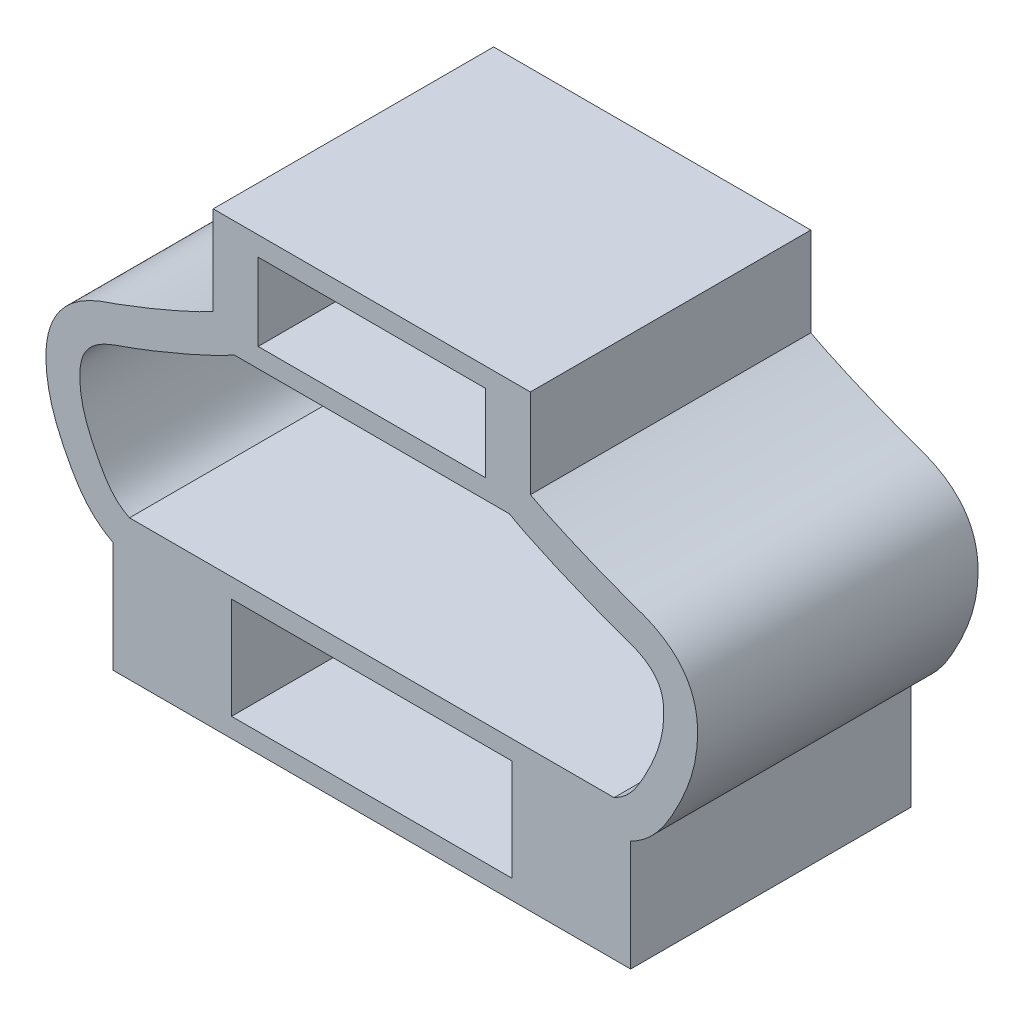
ISO-10303-21;
HEADER;
FILE_DESCRIPTION(('STEP AP214'),'2;1');
FILE_NAME('part.step','',(''),(''),'','','');
FILE_SCHEMA(('AUTOMOTIVE_DESIGN { 1 0 10303 214 1 1 1 1 }'));
ENDSEC;
DATA;
#1=APPLICATION_CONTEXT('core data for automotive mechanical design processes');
#2=APPLICATION_PROTOCOL_DEFINITION('international standard','automotive_design',2000,#1);
#3=PRODUCT_CONTEXT('',#1,'mechanical');
#4=PRODUCT('Part','Part','',(#3));
#5=PRODUCT_RELATED_PRODUCT_CATEGORY('part','',(#4));
#6=PRODUCT_DEFINITION_FORMATION('','',#4);
#7=PRODUCT_DEFINITION_CONTEXT('part definition',#1,'design');
#8=PRODUCT_DEFINITION('design','',#6,#7);
#9=PRODUCT_DEFINITION_SHAPE('','',#8);
#10=(LENGTH_UNIT() NAMED_UNIT(*) SI_UNIT(.MILLI.,.METRE.));
#11=(NAMED_UNIT(*) PLANE_ANGLE_UNIT() SI_UNIT($,.RADIAN.));
#12=(NAMED_UNIT(*) SI_UNIT($,.STERADIAN.) SOLID_ANGLE_UNIT());
#13=UNCERTAINTY_MEASURE_WITH_UNIT(LENGTH_MEASURE(1.E-05),#10,'distance_accuracy_value','');
#14=(GEOMETRIC_REPRESENTATION_CONTEXT(3) GLOBAL_UNCERTAINTY_ASSIGNED_CONTEXT((#13)) GLOBAL_UNIT_ASSIGNED_CONTEXT((#10,
#11,#12)) REPRESENTATION_CONTEXT('',''));
#15=CARTESIAN_POINT('',(0.,0.,0.));
#16=DIRECTION('',(0.,0.,1.));
#17=DIRECTION('',(1.,0.,0.));
#18=AXIS2_PLACEMENT_3D('',#15,#16,#17);
#19=CARTESIAN_POINT('',(0.,0.,5.8));
#20=CARTESIAN_POINT('',(-0.0356656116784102,0.0189747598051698,5.8));
#21=CARTESIAN_POINT('',(-0.0713312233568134,0.0379495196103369,5.8));
#22=CARTESIAN_POINT('',(-0.105594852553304,0.0592637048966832,5.8));
#23=CARTESIAN_POINT('',(-0.134579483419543,0.0772940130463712,5.8));
#24=CARTESIAN_POINT('',(-0.162560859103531,0.0969984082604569,5.8));
#25=CARTESIAN_POINT('',(-0.189547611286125,0.117952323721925,5.8));
#26=CARTESIAN_POINT('',(-0.213832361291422,0.136808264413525,5.8));
#27=CARTESIAN_POINT('',(-0.237311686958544,0.156676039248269,5.8));
#28=CARTESIAN_POINT('',(-0.25987924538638,0.177534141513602,5.8));
#29=CARTESIAN_POINT('',(-0.281164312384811,0.197206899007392,5.8));
#30=CARTESIAN_POINT('',(-0.301638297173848,0.217760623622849,5.8));
#31=CARTESIAN_POINT('',(-0.32134388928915,0.239018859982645,5.8));
#32=CARTESIAN_POINT('',(-0.340594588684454,0.259786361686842,5.8));
#33=CARTESIAN_POINT('',(-0.359111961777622,0.281226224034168,5.8));
#34=CARTESIAN_POINT('',(-0.376972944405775,0.303196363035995,5.8));
#35=CARTESIAN_POINT('',(-0.394883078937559,0.325226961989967,5.8));
#36=CARTESIAN_POINT('',(-0.412133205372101,0.347790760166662,5.8));
#37=CARTESIAN_POINT('',(-0.428825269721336,0.370756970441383,5.8));
#38=CARTESIAN_POINT('',(-0.445892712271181,0.39423965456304,5.8));
#39=CARTESIAN_POINT('',(-0.462376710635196,0.418143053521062,5.8));
#40=CARTESIAN_POINT('',(-0.478383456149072,0.442359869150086,5.8));
#41=CARTESIAN_POINT('',(-0.49499460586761,0.467491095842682,5.8));
#42=CARTESIAN_POINT('',(-0.511091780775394,0.492959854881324,5.8));
#43=CARTESIAN_POINT('',(-0.526778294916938,0.518677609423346,5.8));
#44=CARTESIAN_POINT('',(-0.543247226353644,0.545678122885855,5.8));
#45=CARTESIAN_POINT('',(-0.559263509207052,0.572953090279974,5.8));
#46=CARTESIAN_POINT('',(-0.574924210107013,0.600429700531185,5.8));
#47=CARTESIAN_POINT('',(-0.591521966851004,0.629550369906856,5.8));
#48=CARTESIAN_POINT('',(-0.607720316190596,0.658897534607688,5.8));
#49=CARTESIAN_POINT('',(-0.623606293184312,0.688412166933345,5.8));
#50=CARTESIAN_POINT('',(-0.640578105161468,0.71994417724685,5.8));
#51=CARTESIAN_POINT('',(-0.657193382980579,0.751667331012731,5.8));
#52=CARTESIAN_POINT('',(-0.673540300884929,0.783527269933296,5.8));
#53=CARTESIAN_POINT('',(-0.691128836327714,0.817807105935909,5.8));
#54=CARTESIAN_POINT('',(-0.708406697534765,0.852245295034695,5.8));
#55=CARTESIAN_POINT('',(-0.725417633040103,0.886816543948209,5.8));
#56=CARTESIAN_POINT('',(-0.743154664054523,0.922863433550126,5.8));
#57=CARTESIAN_POINT('',(-0.760601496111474,0.959054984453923,5.8));
#58=CARTESIAN_POINT('',(-0.777433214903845,0.995532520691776,5.8));
#59=CARTESIAN_POINT('',(-0.793526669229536,1.0304100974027,5.8));
#60=CARTESIAN_POINT('',(-0.809057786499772,1.06554912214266,5.8));
#61=CARTESIAN_POINT('',(-0.824004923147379,1.10093482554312,5.8));
#62=CARTESIAN_POINT('',(-0.83829913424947,1.1347747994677,5.8));
#63=CARTESIAN_POINT('',(-0.852059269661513,1.16884037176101,5.8));
#64=CARTESIAN_POINT('',(-0.865202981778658,1.2031431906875,5.8));
#65=CARTESIAN_POINT('',(-0.877830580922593,1.236099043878,5.8));
#66=CARTESIAN_POINT('',(-0.889889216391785,1.26927387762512,5.8));
#67=CARTESIAN_POINT('',(-0.901316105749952,1.30266552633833,5.8));
#68=CARTESIAN_POINT('',(-0.912347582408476,1.33490170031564,5.8));
#69=CARTESIAN_POINT('',(-0.922790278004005,1.3673399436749,5.8));
#70=CARTESIAN_POINT('',(-0.932582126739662,1.39997418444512,5.8));
#71=CARTESIAN_POINT('',(-0.942083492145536,1.4316403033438,5.8));
#72=CARTESIAN_POINT('',(-0.950972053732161,1.46349096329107,5.8));
#73=CARTESIAN_POINT('',(-0.959192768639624,1.49551368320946,5.8));
#74=CARTESIAN_POINT('',(-0.967212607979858,1.52675391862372,5.8));
#75=CARTESIAN_POINT('',(-0.97459683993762,1.55815790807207,5.8));
#76=CARTESIAN_POINT('',(-0.981297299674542,1.58970761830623,5.8));
#77=CARTESIAN_POINT('',(-0.987871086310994,1.62066087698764,5.8));
#78=CARTESIAN_POINT('',(-0.993786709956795,1.65175439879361,5.8));
#79=CARTESIAN_POINT('',(-0.999005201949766,1.68296499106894,5.8));
#80=CARTESIAN_POINT('',(-1.00415542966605,1.71376731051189,5.8));
#81=CARTESIAN_POINT('',(-1.00862664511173,1.74468365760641,5.8));
#82=CARTESIAN_POINT('',(-1.0123879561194,1.77568615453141,5.8));
#83=CARTESIAN_POINT('',(-1.01612300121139,1.80647215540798,5.8));
#84=CARTESIAN_POINT('',(-1.01915802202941,1.83734310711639,5.8));
#85=CARTESIAN_POINT('',(-1.02148000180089,1.8682685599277,5.8));
#86=CARTESIAN_POINT('',(-1.02380048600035,1.89917409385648,5.8));
#87=CARTESIAN_POINT('',(-1.02540884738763,1.93013405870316,5.8));
#88=CARTESIAN_POINT('',(-1.02627890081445,1.96111247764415,5.8));
#89=CARTESIAN_POINT('',(-1.02715407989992,1.99227339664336,5.8));
#90=CARTESIAN_POINT('',(-1.02728222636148,2.02345298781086,5.8));
#91=CARTESIAN_POINT('',(-1.0267446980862,2.05462686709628,5.8));
#92=CARTESIAN_POINT('',(-1.02620551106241,2.08589694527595,5.8));
#93=CARTESIAN_POINT('',(-1.02499653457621,2.11716127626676,5.8));
#94=CARTESIAN_POINT('',(-1.0225110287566,2.14833540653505,5.8));
#95=CARTESIAN_POINT('',(-1.02013548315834,2.17813037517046,5.8));
#96=CARTESIAN_POINT('',(-1.01659385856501,2.20784294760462,5.8));
#97=CARTESIAN_POINT('',(-1.01169371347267,2.23733460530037,5.8));
#98=CARTESIAN_POINT('',(-1.00700127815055,2.26557615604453,5.8));
#99=CARTESIAN_POINT('',(-1.00106305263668,2.2936151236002,5.8));
#100=CARTESIAN_POINT('',(-0.993697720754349,2.32128120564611,5.8));
#101=CARTESIAN_POINT('',(-0.986540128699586,2.34816696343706,5.8));
#102=CARTESIAN_POINT('',(-0.978034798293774,2.37470057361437,5.8));
#103=CARTESIAN_POINT('',(-0.968075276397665,2.40068176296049,5.8));
#104=CARTESIAN_POINT('',(-0.958218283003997,2.42639548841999,5.8));
#105=CARTESIAN_POINT('',(-0.946936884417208,2.45156810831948,5.8));
#106=CARTESIAN_POINT('',(-0.934218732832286,2.47599518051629,5.8));
#107=CARTESIAN_POINT('',(-0.921357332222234,2.50069738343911,5.8));
#108=CARTESIAN_POINT('',(-0.907026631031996,2.52463714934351,5.8));
#109=CARTESIAN_POINT('',(-0.891328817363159,2.54764217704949,5.8));
#110=CARTESIAN_POINT('',(-0.875070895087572,2.57146803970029,5.8));
#111=CARTESIAN_POINT('',(-0.857346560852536,2.59429126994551,5.8));
#112=CARTESIAN_POINT('',(-0.838370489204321,2.61601410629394,5.8));
#113=CARTESIAN_POINT('',(-0.818226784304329,2.63907358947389,5.8));
#114=CARTESIAN_POINT('',(-0.796672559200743,2.66089309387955,5.8));
#115=CARTESIAN_POINT('',(-0.774011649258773,2.68148161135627,5.8));
#116=CARTESIAN_POINT('',(-0.749375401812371,2.70386481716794,5.8));
#117=CARTESIAN_POINT('',(-0.723431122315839,2.72479307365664,5.8));
#118=CARTESIAN_POINT('',(-0.696537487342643,2.74440367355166,5.8));
#119=CARTESIAN_POINT('',(-0.666650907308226,2.76619670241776,5.8));
#120=CARTESIAN_POINT('',(-0.635591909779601,2.78636247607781,5.8));
#121=CARTESIAN_POINT('',(-0.603729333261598,2.80513777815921,5.8));
#122=CARTESIAN_POINT('',(-0.567619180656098,2.82641600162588,5.8));
#123=CARTESIAN_POINT('',(-0.530476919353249,2.84590831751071,5.8));
#124=CARTESIAN_POINT('',(-0.49269045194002,2.86405221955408,5.8));
#125=CARTESIAN_POINT('',(-0.44910675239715,2.88497977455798,5.8));
#126=CARTESIAN_POINT('',(-0.404666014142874,2.90411342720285,5.8));
#127=CARTESIAN_POINT('',(-0.359590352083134,2.92154210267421,5.8));
#128=CARTESIAN_POINT('',(-0.306664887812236,2.94200593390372,5.8));
#129=CARTESIAN_POINT('',(-0.252864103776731,2.96011924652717,5.8));
#130=CARTESIAN_POINT('',(-0.199193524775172,2.97857265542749,5.8));
#131=CARTESIAN_POINT('',(-0.134390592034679,3.00085367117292,5.8));
#132=CARTESIAN_POINT('',(-0.0697774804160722,3.02363050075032,5.8));
#133=CARTESIAN_POINT('',(-0.005355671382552,3.04694820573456,5.8));
#134=CARTESIAN_POINT('',(0.0699267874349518,3.07419696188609,5.8));
#135=CARTESIAN_POINT('',(0.144948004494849,3.10218433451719,5.8));
#136=CARTESIAN_POINT('',(0.219783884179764,3.1306516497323,5.8));
#137=CARTESIAN_POINT('',(0.303039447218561,3.16232178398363,5.8));
#138=CARTESIAN_POINT('',(0.386065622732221,3.19458593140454,5.8));
#139=CARTESIAN_POINT('',(0.468886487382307,3.22737004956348,5.8));
#140=CARTESIAN_POINT('',(0.5566229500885,3.26209997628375,5.8));
#141=CARTESIAN_POINT('',(0.644129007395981,3.29741342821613,5.8));
#142=CARTESIAN_POINT('',(0.731418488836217,3.33325354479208,5.8));
#143=CARTESIAN_POINT('',(0.819501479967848,3.36941946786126,5.8));
#144=CARTESIAN_POINT('',(0.907363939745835,3.40612167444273,5.8));
#145=CARTESIAN_POINT('',(0.994995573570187,3.44336730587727,5.8));
#146=CARTESIAN_POINT('',(1.07930859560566,3.47920244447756,5.8));
#147=CARTESIAN_POINT('',(1.16340794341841,3.51554062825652,5.8));
#148=CARTESIAN_POINT('',(1.24726436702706,3.55243228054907,5.8));
#149=CARTESIAN_POINT('',(1.32431614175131,3.58633030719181,5.8));
#150=CARTESIAN_POINT('',(1.40116281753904,3.62069562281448,5.8));
#151=CARTESIAN_POINT('',(1.47774894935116,3.65563210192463,5.8));
#152=CARTESIAN_POINT('',(1.54509340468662,3.68635278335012,5.8));
#153=CARTESIAN_POINT('',(1.61223640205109,3.71751510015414,5.8));
#154=CARTESIAN_POINT('',(1.67911466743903,3.74924146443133,5.8));
#155=CARTESIAN_POINT('',(1.73550334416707,3.77599167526,5.8));
#156=CARTESIAN_POINT('',(1.79170382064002,3.80314287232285,5.8));
#157=CARTESIAN_POINT('',(1.84758664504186,3.83092814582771,5.8));
#158=CARTESIAN_POINT('',(1.89281660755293,3.8534167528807,5.8));
#159=CARTESIAN_POINT('',(1.93783848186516,3.8763207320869,5.8));
#160=CARTESIAN_POINT('',(1.98260945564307,3.89972557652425,5.8));
#161=CARTESIAN_POINT('',(2.01736917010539,3.91789685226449,5.8));
#162=CARTESIAN_POINT('',(2.05197764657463,3.93637003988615,5.8));
#163=CARTESIAN_POINT('',(2.08605218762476,3.95577916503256,5.8));
#164=CARTESIAN_POINT('',(2.11132741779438,3.97017613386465,5.8));
#165=CARTESIAN_POINT('',(2.13630887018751,3.98508806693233,5.8));
#166=CARTESIAN_POINT('',(2.16129032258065,4.,5.8));
#167=B_SPLINE_CURVE_WITH_KNOTS('',3,(#19,#20,#21,#22,#23,#24,#25,#26,#27,#28,#29,#30,#31,#32,
#33,#34,#35,#36,#37,#38,#39,#40,#41,#42,#43,#44,#45,#46,#47,#48,#49,#50,#51,#52,#53,#54,#55,#56,
#57,#58,#59,#60,#61,#62,#63,#64,#65,#66,#67,#68,#69,#70,#71,#72,#73,#74,#75,#76,#77,#78,#79,#80,
#81,#82,#83,#84,#85,#86,#87,#88,#89,#90,#91,#92,#93,#94,#95,#96,#97,#98,#99,#100,#101,#102,#103,
#104,#105,#106,#107,#108,#109,#110,#111,#112,#113,#114,#115,#116,#117,#118,#119,#120,#121,#122,
#123,#124,#125,#126,#127,#128,#129,#130,#131,#132,#133,#134,#135,#136,#137,#138,#139,#140,#141,
#142,#143,#144,#145,#146,#147,#148,#149,#150,#151,#152,#153,#154,#155,#156,#157,#158,#159,#160,
#161,#162,#163,#164,#165,#166),.UNSPECIFIED.,.F.,.F.,(4,3,3,3,3,3,3,3,3,3,3,3,3,3,3,3,3,3,3,3,3,
3,3,3,3,3,3,3,3,3,3,3,3,3,3,3,3,3,3,3,3,3,3,3,3,3,3,3,3,4),(0.,0.12108864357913,
0.22352115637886,0.31569778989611,0.40263611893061,0.48756752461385,0.57273265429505,
0.65981301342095,0.75018146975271,0.84505735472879,0.94561012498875,1.05303585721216,
1.16862102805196,1.28913984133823,1.4043725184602,1.51457156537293,1.62044343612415,
1.7226517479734,1.82182796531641,1.91858078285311,2.01350447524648,2.10718644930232,
2.20021422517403,2.29318208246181,2.38669763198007,2.48050175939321,2.57015593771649,
2.65600981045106,2.73944216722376,2.82201562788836,2.90551914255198,2.99200211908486,
3.0838065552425,3.18361352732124,3.2945278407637,3.42022805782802,3.56521330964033,
3.73544734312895,3.94099132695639,4.18118725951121,4.44840731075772,4.73148745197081,
5.01714094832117,5.29197674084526,5.54451059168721,5.76657109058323,5.95380228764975,
6.10534187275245,6.22299561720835,6.31026679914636),.UNSPECIFIED.);
#168=DIRECTION('',(0.,0.,-1.));
#169=VECTOR('',#168,1.);
#170=SURFACE_OF_LINEAR_EXTRUSION('',#167,#169);
#171=CARTESIAN_POINT('',(0.,0.,0.));
#172=CARTESIAN_POINT('',(-0.0356656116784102,0.0189747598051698,0.));
#173=CARTESIAN_POINT('',(-0.0713312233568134,0.0379495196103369,0.));
#174=CARTESIAN_POINT('',(-0.105594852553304,0.0592637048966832,0.));
#175=CARTESIAN_POINT('',(-0.134579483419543,0.0772940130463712,0.));
#176=CARTESIAN_POINT('',(-0.162560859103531,0.0969984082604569,0.));
#177=CARTESIAN_POINT('',(-0.189547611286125,0.117952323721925,0.));
#178=CARTESIAN_POINT('',(-0.213832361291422,0.136808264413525,0.));
#179=CARTESIAN_POINT('',(-0.237311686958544,0.156676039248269,0.));
#180=CARTESIAN_POINT('',(-0.25987924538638,0.177534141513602,0.));
#181=CARTESIAN_POINT('',(-0.281164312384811,0.197206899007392,0.));
#182=CARTESIAN_POINT('',(-0.301638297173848,0.217760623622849,0.));
#183=CARTESIAN_POINT('',(-0.32134388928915,0.239018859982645,0.));
#184=CARTESIAN_POINT('',(-0.340594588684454,0.259786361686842,0.));
#185=CARTESIAN_POINT('',(-0.359111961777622,0.281226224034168,0.));
#186=CARTESIAN_POINT('',(-0.376972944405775,0.303196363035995,0.));
#187=CARTESIAN_POINT('',(-0.394883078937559,0.325226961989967,0.));
#188=CARTESIAN_POINT('',(-0.412133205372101,0.347790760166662,0.));
#189=CARTESIAN_POINT('',(-0.428825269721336,0.370756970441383,0.));
#190=CARTESIAN_POINT('',(-0.445892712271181,0.39423965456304,0.));
#191=CARTESIAN_POINT('',(-0.462376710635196,0.418143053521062,0.));
#192=CARTESIAN_POINT('',(-0.478383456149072,0.442359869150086,0.));
#193=CARTESIAN_POINT('',(-0.49499460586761,0.467491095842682,0.));
#194=CARTESIAN_POINT('',(-0.511091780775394,0.492959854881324,0.));
#195=CARTESIAN_POINT('',(-0.526778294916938,0.518677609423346,0.));
#196=CARTESIAN_POINT('',(-0.543247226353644,0.545678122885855,0.));
#197=CARTESIAN_POINT('',(-0.559263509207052,0.572953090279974,0.));
#198=CARTESIAN_POINT('',(-0.574924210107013,0.600429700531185,0.));
#199=CARTESIAN_POINT('',(-0.591521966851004,0.629550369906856,0.));
#200=CARTESIAN_POINT('',(-0.607720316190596,0.658897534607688,0.));
#201=CARTESIAN_POINT('',(-0.623606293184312,0.688412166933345,0.));
#202=CARTESIAN_POINT('',(-0.640578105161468,0.71994417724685,0.));
#203=CARTESIAN_POINT('',(-0.657193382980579,0.751667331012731,0.));
#204=CARTESIAN_POINT('',(-0.673540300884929,0.783527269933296,0.));
#205=CARTESIAN_POINT('',(-0.691128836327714,0.817807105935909,0.));
#206=CARTESIAN_POINT('',(-0.708406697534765,0.852245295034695,0.));
#207=CARTESIAN_POINT('',(-0.725417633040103,0.886816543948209,0.));
#208=CARTESIAN_POINT('',(-0.743154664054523,0.922863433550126,0.));
#209=CARTESIAN_POINT('',(-0.760601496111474,0.959054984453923,0.));
#210=CARTESIAN_POINT('',(-0.777433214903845,0.995532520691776,0.));
#211=CARTESIAN_POINT('',(-0.793526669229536,1.0304100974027,0.));
#212=CARTESIAN_POINT('',(-0.809057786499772,1.06554912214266,0.));
#213=CARTESIAN_POINT('',(-0.824004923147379,1.10093482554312,0.));
#214=CARTESIAN_POINT('',(-0.83829913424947,1.1347747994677,0.));
#215=CARTESIAN_POINT('',(-0.852059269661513,1.16884037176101,0.));
#216=CARTESIAN_POINT('',(-0.865202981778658,1.2031431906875,0.));
#217=CARTESIAN_POINT('',(-0.877830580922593,1.236099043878,0.));
#218=CARTESIAN_POINT('',(-0.889889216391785,1.26927387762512,0.));
#219=CARTESIAN_POINT('',(-0.901316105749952,1.30266552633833,0.));
#220=CARTESIAN_POINT('',(-0.912347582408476,1.33490170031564,0.));
#221=CARTESIAN_POINT('',(-0.922790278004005,1.3673399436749,0.));
#222=CARTESIAN_POINT('',(-0.932582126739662,1.39997418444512,0.));
#223=CARTESIAN_POINT('',(-0.942083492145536,1.4316403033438,0.));
#224=CARTESIAN_POINT('',(-0.950972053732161,1.46349096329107,0.));
#225=CARTESIAN_POINT('',(-0.959192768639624,1.49551368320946,0.));
#226=CARTESIAN_POINT('',(-0.967212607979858,1.52675391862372,0.));
#227=CARTESIAN_POINT('',(-0.97459683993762,1.55815790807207,0.));
#228=CARTESIAN_POINT('',(-0.981297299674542,1.58970761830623,0.));
#229=CARTESIAN_POINT('',(-0.987871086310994,1.62066087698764,0.));
#230=CARTESIAN_POINT('',(-0.993786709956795,1.65175439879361,0.));
#231=CARTESIAN_POINT('',(-0.999005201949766,1.68296499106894,0.));
#232=CARTESIAN_POINT('',(-1.00415542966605,1.71376731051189,0.));
#233=CARTESIAN_POINT('',(-1.00862664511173,1.74468365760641,0.));
#234=CARTESIAN_POINT('',(-1.0123879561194,1.77568615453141,0.));
#235=CARTESIAN_POINT('',(-1.01612300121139,1.80647215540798,0.));
#236=CARTESIAN_POINT('',(-1.01915802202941,1.83734310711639,0.));
#237=CARTESIAN_POINT('',(-1.02148000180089,1.8682685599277,0.));
#238=CARTESIAN_POINT('',(-1.02380048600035,1.89917409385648,0.));
#239=CARTESIAN_POINT('',(-1.02540884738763,1.93013405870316,0.));
#240=CARTESIAN_POINT('',(-1.02627890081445,1.96111247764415,0.));
#241=CARTESIAN_POINT('',(-1.02715407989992,1.99227339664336,0.));
#242=CARTESIAN_POINT('',(-1.02728222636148,2.02345298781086,0.));
#243=CARTESIAN_POINT('',(-1.0267446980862,2.05462686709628,0.));
#244=CARTESIAN_POINT('',(-1.02620551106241,2.08589694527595,0.));
#245=CARTESIAN_POINT('',(-1.02499653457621,2.11716127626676,0.));
#246=CARTESIAN_POINT('',(-1.0225110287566,2.14833540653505,0.));
#247=CARTESIAN_POINT('',(-1.02013548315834,2.17813037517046,0.));
#248=CARTESIAN_POINT('',(-1.01659385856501,2.20784294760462,0.));
#249=CARTESIAN_POINT('',(-1.01169371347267,2.23733460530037,0.));
#250=CARTESIAN_POINT('',(-1.00700127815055,2.26557615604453,0.));
#251=CARTESIAN_POINT('',(-1.00106305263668,2.2936151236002,0.));
#252=CARTESIAN_POINT('',(-0.993697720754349,2.32128120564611,0.));
#253=CARTESIAN_POINT('',(-0.986540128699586,2.34816696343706,0.));
#254=CARTESIAN_POINT('',(-0.978034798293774,2.37470057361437,0.));
#255=CARTESIAN_POINT('',(-0.968075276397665,2.40068176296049,0.));
#256=CARTESIAN_POINT('',(-0.958218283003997,2.42639548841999,0.));
#257=CARTESIAN_POINT('',(-0.946936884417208,2.45156810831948,0.));
#258=CARTESIAN_POINT('',(-0.934218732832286,2.47599518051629,0.));
#259=CARTESIAN_POINT('',(-0.921357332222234,2.50069738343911,0.));
#260=CARTESIAN_POINT('',(-0.907026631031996,2.52463714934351,0.));
#261=CARTESIAN_POINT('',(-0.891328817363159,2.54764217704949,0.));
#262=CARTESIAN_POINT('',(-0.875070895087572,2.57146803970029,0.));
#263=CARTESIAN_POINT('',(-0.857346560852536,2.59429126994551,0.));
#264=CARTESIAN_POINT('',(-0.838370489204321,2.61601410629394,0.));
#265=CARTESIAN_POINT('',(-0.818226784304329,2.63907358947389,0.));
#266=CARTESIAN_POINT('',(-0.796672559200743,2.66089309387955,0.));
#267=CARTESIAN_POINT('',(-0.774011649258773,2.68148161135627,0.));
#268=CARTESIAN_POINT('',(-0.749375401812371,2.70386481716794,0.));
#269=CARTESIAN_POINT('',(-0.723431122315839,2.72479307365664,0.));
#270=CARTESIAN_POINT('',(-0.696537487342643,2.74440367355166,0.));
#271=CARTESIAN_POINT('',(-0.666650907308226,2.76619670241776,0.));
#272=CARTESIAN_POINT('',(-0.635591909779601,2.78636247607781,0.));
#273=CARTESIAN_POINT('',(-0.603729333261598,2.80513777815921,0.));
#274=CARTESIAN_POINT('',(-0.567619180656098,2.82641600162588,0.));
#275=CARTESIAN_POINT('',(-0.530476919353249,2.84590831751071,0.));
#276=CARTESIAN_POINT('',(-0.49269045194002,2.86405221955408,0.));
#277=CARTESIAN_POINT('',(-0.44910675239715,2.88497977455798,0.));
#278=CARTESIAN_POINT('',(-0.404666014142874,2.90411342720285,0.));
#279=CARTESIAN_POINT('',(-0.359590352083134,2.92154210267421,0.));
#280=CARTESIAN_POINT('',(-0.306664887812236,2.94200593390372,0.));
#281=CARTESIAN_POINT('',(-0.252864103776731,2.96011924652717,0.));
#282=CARTESIAN_POINT('',(-0.199193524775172,2.97857265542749,0.));
#283=CARTESIAN_POINT('',(-0.134390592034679,3.00085367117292,0.));
#284=CARTESIAN_POINT('',(-0.0697774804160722,3.02363050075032,0.));
#285=CARTESIAN_POINT('',(-0.005355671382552,3.04694820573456,0.));
#286=CARTESIAN_POINT('',(0.0699267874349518,3.07419696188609,0.));
#287=CARTESIAN_POINT('',(0.144948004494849,3.10218433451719,0.));
#288=CARTESIAN_POINT('',(0.219783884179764,3.1306516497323,0.));
#289=CARTESIAN_POINT('',(0.303039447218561,3.16232178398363,0.));
#290=CARTESIAN_POINT('',(0.386065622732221,3.19458593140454,0.));
#291=CARTESIAN_POINT('',(0.468886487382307,3.22737004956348,0.));
#292=CARTESIAN_POINT('',(0.5566229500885,3.26209997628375,0.));
#293=CARTESIAN_POINT('',(0.644129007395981,3.29741342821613,0.));
#294=CARTESIAN_POINT('',(0.731418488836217,3.33325354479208,0.));
#295=CARTESIAN_POINT('',(0.819501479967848,3.36941946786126,0.));
#296=CARTESIAN_POINT('',(0.907363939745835,3.40612167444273,0.));
#297=CARTESIAN_POINT('',(0.994995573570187,3.44336730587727,0.));
#298=CARTESIAN_POINT('',(1.07930859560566,3.47920244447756,0.));
#299=CARTESIAN_POINT('',(1.16340794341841,3.51554062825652,0.));
#300=CARTESIAN_POINT('',(1.24726436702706,3.55243228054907,0.));
#301=CARTESIAN_POINT('',(1.32431614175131,3.58633030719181,0.));
#302=CARTESIAN_POINT('',(1.40116281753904,3.62069562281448,0.));
#303=CARTESIAN_POINT('',(1.47774894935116,3.65563210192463,0.));
#304=CARTESIAN_POINT('',(1.54509340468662,3.68635278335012,0.));
#305=CARTESIAN_POINT('',(1.61223640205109,3.71751510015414,0.));
#306=CARTESIAN_POINT('',(1.67911466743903,3.74924146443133,0.));
#307=CARTESIAN_POINT('',(1.73550334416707,3.77599167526,0.));
#308=CARTESIAN_POINT('',(1.79170382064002,3.80314287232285,0.));
#309=CARTESIAN_POINT('',(1.84758664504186,3.83092814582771,0.));
#310=CARTESIAN_POINT('',(1.89281660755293,3.8534167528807,0.));
#311=CARTESIAN_POINT('',(1.93783848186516,3.8763207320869,0.));
#312=CARTESIAN_POINT('',(1.98260945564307,3.89972557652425,0.));
#313=CARTESIAN_POINT('',(2.01736917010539,3.91789685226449,0.));
#314=CARTESIAN_POINT('',(2.05197764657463,3.93637003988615,0.));
#315=CARTESIAN_POINT('',(2.08605218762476,3.95577916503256,0.));
#316=CARTESIAN_POINT('',(2.11132741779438,3.97017613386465,0.));
#317=CARTESIAN_POINT('',(2.13630887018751,3.98508806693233,0.));
#318=CARTESIAN_POINT('',(2.16129032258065,4.,0.));
#319=B_SPLINE_CURVE_WITH_KNOTS('',3,(#171,#172,#173,#174,#175,#176,#177,#178,#179,#180,#181,
#182,#183,#184,#185,#186,#187,#188,#189,#190,#191,#192,#193,#194,#195,#196,#197,#198,#199,#200,
#201,#202,#203,#204,#205,#206,#207,#208,#209,#210,#211,#212,#213,#214,#215,#216,#217,#218,#219,
#220,#221,#222,#223,#224,#225,#226,#227,#228,#229,#230,#231,#232,#233,#234,#235,#236,#237,#238,
#239,#240,#241,#242,#243,#244,#245,#246,#247,#248,#249,#250,#251,#252,#253,#254,#255,#256,#257,
#258,#259,#260,#261,#262,#263,#264,#265,#266,#267,#268,#269,#270,#271,#272,#273,#274,#275,#276,
#277,#278,#279,#280,#281,#282,#283,#284,#285,#286,#287,#288,#289,#290,#291,#292,#293,#294,#295,
#296,#297,#298,#299,#300,#301,#302,#303,#304,#305,#306,#307,#308,#309,#310,#311,#312,#313,#314,
#315,#316,#317,#318),.UNSPECIFIED.,.F.,.F.,(4,3,3,3,3,3,3,3,3,3,3,3,3,3,3,3,3,3,3,3,3,3,3,3,3,3,
3,3,3,3,3,3,3,3,3,3,3,3,3,3,3,3,3,3,3,3,3,3,3,4),(0.,0.12108864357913,0.22352115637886,
0.31569778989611,0.40263611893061,0.48756752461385,0.57273265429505,0.65981301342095,
0.75018146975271,0.84505735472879,0.94561012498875,1.05303585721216,1.16862102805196,
1.28913984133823,1.4043725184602,1.51457156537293,1.62044343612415,1.7226517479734,
1.82182796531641,1.91858078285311,2.01350447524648,2.10718644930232,2.20021422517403,
2.29318208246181,2.38669763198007,2.48050175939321,2.57015593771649,2.65600981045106,
2.73944216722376,2.82201562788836,2.90551914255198,2.99200211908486,3.0838065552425,
3.18361352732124,3.2945278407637,3.42022805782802,3.56521330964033,3.73544734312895,
3.94099132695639,4.18118725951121,4.44840731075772,4.73148745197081,5.01714094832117,
5.29197674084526,5.54451059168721,5.76657109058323,5.95380228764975,6.10534187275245,
6.22299561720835,6.31026679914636),.UNSPECIFIED.);
#320=CARTESIAN_POINT('',(0.,0.,0.));
#321=VERTEX_POINT('',#320);
#322=CARTESIAN_POINT('',(2.16129032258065,4.,0.));
#323=VERTEX_POINT('',#322);
#324=EDGE_CURVE('E157',#321,#323,#319,.T.);
#325=ORIENTED_EDGE('',*,*,#324,.T.);
#326=DIRECTION('',(0.,0.,-1.));
#327=VECTOR('',#326,1.);
#328=CARTESIAN_POINT('',(2.16129032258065,4.,5.8));
#329=LINE('',#328,#327);
#330=CARTESIAN_POINT('',(2.16129032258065,4.,5.8));
#331=VERTEX_POINT('',#330);
#332=EDGE_CURVE('E11',#331,#323,#329,.T.);
#333=ORIENTED_EDGE('',*,*,#332,.F.);
#334=CARTESIAN_POINT('',(0.,0.,5.8));
#335=VERTEX_POINT('',#334);
#336=EDGE_CURVE('E198',#335,#331,#167,.T.);
#337=ORIENTED_EDGE('',*,*,#336,.F.);
#338=DIRECTION('',(0.,0.,-1.));
#339=VECTOR('',#338,1.);
#340=CARTESIAN_POINT('',(0.,0.,5.8));
#341=LINE('',#340,#339);
#342=EDGE_CURVE('E156',#335,#321,#341,.T.);
#343=ORIENTED_EDGE('',*,*,#342,.T.);
#344=EDGE_LOOP('',(#325,#333,#337,#343));
#345=FACE_BOUND('',#344,.T.);
#346=ADVANCED_FACE('F32',(#345),#170,.F.);
#347=CARTESIAN_POINT('',(2.16129032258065,4.,5.8));
#348=DIRECTION('',(0.,1.,0.));
#349=DIRECTION('',(0.,0.,1.));
#350=AXIS2_PLACEMENT_3D('',#347,#348,#349);
#351=PLANE('',#350);
#352=DIRECTION('',(1.,0.,0.));
#353=VECTOR('',#352,1.);
#354=CARTESIAN_POINT('',(2.16129032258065,4.,0.));
#355=LINE('',#354,#353);
#356=CARTESIAN_POINT('',(7.86129032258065,4.,0.));
#357=VERTEX_POINT('',#356);
#358=EDGE_CURVE('E162',#323,#357,#355,.T.);
#359=ORIENTED_EDGE('',*,*,#358,.T.);
#360=DIRECTION('',(0.,0.,-1.));
#361=VECTOR('',#360,1.);
#362=CARTESIAN_POINT('',(7.86129032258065,4.,5.8));
#363=LINE('',#362,#361);
#364=CARTESIAN_POINT('',(7.86129032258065,4.,5.8));
#365=VERTEX_POINT('',#364);
#366=EDGE_CURVE('E255',#365,#357,#363,.T.);
#367=ORIENTED_EDGE('',*,*,#366,.F.);
#368=DIRECTION('',(1.,0.,0.));
#369=VECTOR('',#368,1.);
#370=CARTESIAN_POINT('',(2.16129032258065,4.,5.8));
#371=LINE('',#370,#369);
#372=EDGE_CURVE('E101',#331,#365,#371,.T.);
#373=ORIENTED_EDGE('',*,*,#372,.F.);
#374=ORIENTED_EDGE('',*,*,#332,.T.);
#375=EDGE_LOOP('',(#359,#367,#373,#374));
#376=FACE_BOUND('',#375,.T.);
#377=ADVANCED_FACE('F321',(#376),#351,.F.);
#378=CARTESIAN_POINT('',(5.01129032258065,4.4,5.8));
#379=DIRECTION('',(0.,-1.,0.));
#380=DIRECTION('',(0.,0.,-1.));
#381=AXIS2_PLACEMENT_3D('',#378,#379,#380);
#382=PLANE('',#381);
#383=DIRECTION('',(-1.,0.,0.));
#384=VECTOR('',#383,1.);
#385=CARTESIAN_POINT('',(5.01129032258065,4.4,0.));
#386=LINE('',#385,#384);
#387=CARTESIAN_POINT('',(7.36129032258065,4.4,0.));
#388=VERTEX_POINT('',#387);
#389=CARTESIAN_POINT('',(2.66129032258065,4.4,0.));
#390=VERTEX_POINT('',#389);
#391=EDGE_CURVE('E169',#388,#390,#386,.T.);
#392=ORIENTED_EDGE('',*,*,#391,.T.);
#393=DIRECTION('',(0.,0.,-1.));
#394=VECTOR('',#393,1.);
#395=CARTESIAN_POINT('',(2.66129032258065,4.4,5.8));
#396=LINE('',#395,#394);
#397=CARTESIAN_POINT('',(2.66129032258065,4.4,5.8));
#398=VERTEX_POINT('',#397);
#399=EDGE_CURVE('E41',#398,#390,#396,.T.);
#400=ORIENTED_EDGE('',*,*,#399,.F.);
#401=DIRECTION('',(-1.,0.,0.));
#402=VECTOR('',#401,1.);
#403=CARTESIAN_POINT('',(5.01129032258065,4.4,5.8));
#404=LINE('',#403,#402);
#405=CARTESIAN_POINT('',(7.36129032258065,4.4,5.8));
#406=VERTEX_POINT('',#405);
#407=EDGE_CURVE('E280',#406,#398,#404,.T.);
#408=ORIENTED_EDGE('',*,*,#407,.F.);
#409=DIRECTION('',(0.,0.,-1.));
#410=VECTOR('',#409,1.);
#411=CARTESIAN_POINT('',(7.36129032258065,4.4,5.8));
#412=LINE('',#411,#410);
#413=EDGE_CURVE('E250',#406,#388,#412,.T.);
#414=ORIENTED_EDGE('',*,*,#413,.T.);
#415=EDGE_LOOP('',(#392,#400,#408,#414));
#416=FACE_BOUND('',#415,.T.);
#417=ADVANCED_FACE('F319',(#416),#382,.F.);
#418=CARTESIAN_POINT('',(2.66129032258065,4.4,5.8));
#419=DIRECTION('',(-1.,0.,0.));
#420=DIRECTION('',(0.,-1.,0.));
#421=AXIS2_PLACEMENT_3D('',#418,#419,#420);
#422=PLANE('',#421);
#423=DIRECTION('',(0.,1.,0.));
#424=VECTOR('',#423,1.);
#425=CARTESIAN_POINT('',(2.66129032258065,4.4,0.));
#426=LINE('',#425,#424);
#427=CARTESIAN_POINT('',(2.66129032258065,6.,0.));
#428=VERTEX_POINT('',#427);
#429=EDGE_CURVE('E171',#390,#428,#426,.T.);
#430=ORIENTED_EDGE('',*,*,#429,.T.);
#431=DIRECTION('',(0.,0.,-1.));
#432=VECTOR('',#431,1.);
#433=CARTESIAN_POINT('',(2.66129032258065,6.,5.8));
#434=LINE('',#433,#432);
#435=CARTESIAN_POINT('',(2.66129032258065,6.,5.8));
#436=VERTEX_POINT('',#435);
#437=EDGE_CURVE('E212',#436,#428,#434,.T.);
#438=ORIENTED_EDGE('',*,*,#437,.F.);
#439=DIRECTION('',(0.,1.,0.));
#440=VECTOR('',#439,1.);
#441=CARTESIAN_POINT('',(2.66129032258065,4.4,5.8));
#442=LINE('',#441,#440);
#443=EDGE_CURVE('E221',#398,#436,#442,.T.);
#444=ORIENTED_EDGE('',*,*,#443,.F.);
#445=ORIENTED_EDGE('',*,*,#399,.T.);
#446=EDGE_LOOP('',(#430,#438,#444,#445));
#447=FACE_BOUND('',#446,.T.);
#448=ADVANCED_FACE('F219',(#447),#422,.F.);
#449=CARTESIAN_POINT('',(2.66129032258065,6.,5.8));
#450=DIRECTION('',(0.,1.,0.));
#451=DIRECTION('',(0.,0.,1.));
#452=AXIS2_PLACEMENT_3D('',#449,#450,#451);
#453=PLANE('',#452);
#454=DIRECTION('',(1.,0.,0.));
#455=VECTOR('',#454,1.);
#456=CARTESIAN_POINT('',(2.66129032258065,6.,0.));
#457=LINE('',#456,#455);
#458=CARTESIAN_POINT('',(7.36129032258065,6.,0.));
#459=VERTEX_POINT('',#458);
#460=EDGE_CURVE('E173',#428,#459,#457,.T.);
#461=ORIENTED_EDGE('',*,*,#460,.T.);
#462=DIRECTION('',(0.,0.,-1.));
#463=VECTOR('',#462,1.);
#464=CARTESIAN_POINT('',(7.36129032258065,6.,5.8));
#465=LINE('',#464,#463);
#466=CARTESIAN_POINT('',(7.36129032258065,6.,5.8));
#467=VERTEX_POINT('',#466);
#468=EDGE_CURVE('E240',#467,#459,#465,.T.);
#469=ORIENTED_EDGE('',*,*,#468,.F.);
#470=DIRECTION('',(1.,0.,0.));
#471=VECTOR('',#470,1.);
#472=CARTESIAN_POINT('',(2.66129032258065,6.,5.8));
#473=LINE('',#472,#471);
#474=EDGE_CURVE('E283',#436,#467,#473,.T.);
#475=ORIENTED_EDGE('',*,*,#474,.F.);
#476=ORIENTED_EDGE('',*,*,#437,.T.);
#477=EDGE_LOOP('',(#461,#469,#475,#476));
#478=FACE_BOUND('',#477,.T.);
#479=ADVANCED_FACE('F237',(#478),#453,.F.);
#480=CARTESIAN_POINT('',(5.01129032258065,6.4,5.8));
#481=DIRECTION('',(0.,-1.,0.));
#482=DIRECTION('',(0.,0.,-1.));
#483=AXIS2_PLACEMENT_3D('',#480,#481,#482);
#484=PLANE('',#483);
#485=DIRECTION('',(-1.,0.,0.));
#486=VECTOR('',#485,1.);
#487=CARTESIAN_POINT('',(5.01129032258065,6.4,0.));
#488=LINE('',#487,#486);
#489=CARTESIAN_POINT('',(8.2912226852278,6.4,0.));
#490=VERTEX_POINT('',#489);
#491=CARTESIAN_POINT('',(1.7313579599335,6.4,0.));
#492=VERTEX_POINT('',#491);
#493=EDGE_CURVE('E176',#490,#492,#488,.T.);
#494=ORIENTED_EDGE('',*,*,#493,.T.);
#495=DIRECTION('',(0.,0.,-1.));
#496=VECTOR('',#495,1.);
#497=CARTESIAN_POINT('',(1.7313579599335,6.4,5.8));
#498=LINE('',#497,#496);
#499=CARTESIAN_POINT('',(1.7313579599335,6.4,5.8));
#500=VERTEX_POINT('',#499);
#501=EDGE_CURVE('E209',#500,#492,#498,.T.);
#502=ORIENTED_EDGE('',*,*,#501,.F.);
#503=DIRECTION('',(-1.,0.,0.));
#504=VECTOR('',#503,1.);
#505=CARTESIAN_POINT('',(5.01129032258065,6.4,5.8));
#506=LINE('',#505,#504);
#507=CARTESIAN_POINT('',(8.2912226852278,6.4,5.8));
#508=VERTEX_POINT('',#507);
#509=EDGE_CURVE('E286',#508,#500,#506,.T.);
#510=ORIENTED_EDGE('',*,*,#509,.F.);
#511=DIRECTION('',(0.,0.,-1.));
#512=VECTOR('',#511,1.);
#513=CARTESIAN_POINT('',(8.2912226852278,6.4,5.8));
#514=LINE('',#513,#512);
#515=EDGE_CURVE('E249',#508,#490,#514,.T.);
#516=ORIENTED_EDGE('',*,*,#515,.T.);
#517=EDGE_LOOP('',(#494,#502,#510,#516));
#518=FACE_BOUND('',#517,.T.);
#519=ADVANCED_FACE('F310',(#518),#484,.F.);
#520=CARTESIAN_POINT('',(1.7313579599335,6.4,5.8));
#521=DIRECTION('',(1.,0.,0.));
#522=DIRECTION('',(0.,1.,0.));
#523=AXIS2_PLACEMENT_3D('',#520,#521,#522);
#524=PLANE('',#523);
#525=DIRECTION('',(0.,-1.,0.));
#526=VECTOR('',#525,1.);
#527=CARTESIAN_POINT('',(1.7313579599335,6.4,0.));
#528=LINE('',#527,#526);
#529=CARTESIAN_POINT('',(1.7313579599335,4.55926239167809,0.));
#530=VERTEX_POINT('',#529);
#531=EDGE_CURVE('E178',#492,#530,#528,.T.);
#532=ORIENTED_EDGE('',*,*,#531,.T.);
#533=DIRECTION('',(0.,0.,-1.));
#534=VECTOR('',#533,1.);
#535=CARTESIAN_POINT('',(1.7313579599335,4.55926239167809,5.8));
#536=LINE('',#535,#534);
#537=CARTESIAN_POINT('',(1.7313579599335,4.55926239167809,5.8));
#538=VERTEX_POINT('',#537);
#539=EDGE_CURVE('E206',#538,#530,#536,.T.);
#540=ORIENTED_EDGE('',*,*,#539,.F.);
#541=DIRECTION('',(0.,-1.,0.));
#542=VECTOR('',#541,1.);
#543=CARTESIAN_POINT('',(1.7313579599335,6.4,5.8));
#544=LINE('',#543,#542);
#545=EDGE_CURVE('E288',#500,#538,#544,.T.);
#546=ORIENTED_EDGE('',*,*,#545,.F.);
#547=ORIENTED_EDGE('',*,*,#501,.T.);
#548=EDGE_LOOP('',(#532,#540,#546,#547));
#549=FACE_BOUND('',#548,.T.);
#550=ADVANCED_FACE('F305',(#549),#524,.F.);
#551=CARTESIAN_POINT('',(1.7313579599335,4.55926239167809,5.8));
#552=CARTESIAN_POINT('',(1.70400198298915,4.54445218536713,5.8));
#553=CARTESIAN_POINT('',(1.6766460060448,4.52964197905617,5.8));
#554=CARTESIAN_POINT('',(1.64910955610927,4.51517485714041,5.8));
#555=CARTESIAN_POINT('',(1.60962914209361,4.49443260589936,5.8));
#556=CARTESIAN_POINT('',(1.56977774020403,4.47439561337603,5.8));
#557=CARTESIAN_POINT('',(1.52979376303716,4.45463295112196,5.8));
#558=CARTESIAN_POINT('',(1.47797659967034,4.42902156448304,5.8));
#559=CARTESIAN_POINT('',(1.42593677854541,4.40387091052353,5.8));
#560=CARTESIAN_POINT('',(1.37371322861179,4.37910649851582,5.8));
#561=CARTESIAN_POINT('',(1.3102717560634,4.34902254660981,5.8));
#562=CARTESIAN_POINT('',(1.24655914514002,4.31950859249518,5.8));
#563=CARTESIAN_POINT('',(1.18266470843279,4.29039606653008,5.8));
#564=CARTESIAN_POINT('',(1.10907102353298,4.25686422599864,5.8));
#565=CARTESIAN_POINT('',(1.03523612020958,4.22386493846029,5.8));
#566=CARTESIAN_POINT('',(0.961204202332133,4.19131378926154,5.8));
#567=CARTESIAN_POINT('',(0.880098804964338,4.15565249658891,5.8));
#568=CARTESIAN_POINT('',(0.798756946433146,4.1205290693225,5.8));
#569=CARTESIAN_POINT('',(0.717209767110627,4.08588971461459,5.8));
#570=CARTESIAN_POINT('',(0.632220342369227,4.04978817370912,5.8));
#571=CARTESIAN_POINT('',(0.547007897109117,4.01421243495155,5.8));
#572=CARTESIAN_POINT('',(0.461582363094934,3.97915482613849,5.8));
#573=CARTESIAN_POINT('',(0.376956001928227,3.94442518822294,5.8));
#574=CARTESIAN_POINT('',(0.292120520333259,3.91020403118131,5.8));
#575=CARTESIAN_POINT('',(0.207057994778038,3.87655865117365,5.8));
#576=CARTESIAN_POINT('',(0.127051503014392,3.84491311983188,5.8));
#577=CARTESIAN_POINT('',(0.0468441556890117,3.81377695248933,5.8));
#578=CARTESIAN_POINT('',(-0.0335761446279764,3.78319183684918,5.8));
#579=CARTESIAN_POINT('',(-0.105273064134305,3.7559243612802,5.8));
#580=CARTESIAN_POINT('',(-0.177139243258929,3.72909487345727,5.8));
#581=CARTESIAN_POINT('',(-0.24929157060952,3.70306959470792,5.8));
#582=CARTESIAN_POINT('',(-0.310046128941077,3.68115548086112,5.8));
#583=CARTESIAN_POINT('',(-0.371003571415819,3.65981156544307,5.8));
#584=CARTESIAN_POINT('',(-0.43205310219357,3.63870629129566,5.8));
#585=CARTESIAN_POINT('',(-0.486240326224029,3.61997336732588,5.8));
#586=CARTESIAN_POINT('',(-0.540500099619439,3.60142845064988,5.8));
#587=CARTESIAN_POINT('',(-0.594099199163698,3.58109164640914,5.8));
#588=CARTESIAN_POINT('',(-0.653697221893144,3.55847870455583,5.8));
#589=CARTESIAN_POINT('',(-0.712478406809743,3.53365032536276,5.8));
#590=CARTESIAN_POINT('',(-0.770256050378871,3.50666978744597,5.8));
#591=CARTESIAN_POINT('',(-0.825157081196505,3.48103254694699,5.8));
#592=CARTESIAN_POINT('',(-0.879152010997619,3.4534521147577,5.8));
#593=CARTESIAN_POINT('',(-0.931812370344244,3.42349165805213,5.8));
#594=CARTESIAN_POINT('',(-0.982530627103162,3.39463613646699,5.8));
#595=CARTESIAN_POINT('',(-1.03201093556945,3.36357290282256,5.8));
#596=CARTESIAN_POINT('',(-1.07984124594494,3.33013247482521,5.8));
#597=CARTESIAN_POINT('',(-1.12673312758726,3.29734814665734,5.8));
#598=CARTESIAN_POINT('',(-1.17203912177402,3.26227898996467,5.8));
#599=CARTESIAN_POINT('',(-1.21531792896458,3.22484959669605,5.8));
#600=CARTESIAN_POINT('',(-1.25819212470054,3.18777012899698,5.8));
#601=CARTESIAN_POINT('',(-1.29907686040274,3.14837434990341,5.8));
#602=CARTESIAN_POINT('',(-1.3375539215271,3.1067440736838,5.8));
#603=CARTESIAN_POINT('',(-1.37577412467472,3.0653917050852,5.8));
#604=CARTESIAN_POINT('',(-1.41161869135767,3.02183457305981,5.8));
#605=CARTESIAN_POINT('',(-1.44473657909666,2.97629104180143,5.8));
#606=CARTESIAN_POINT('',(-1.47751703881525,2.93121153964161,5.8));
#607=CARTESIAN_POINT('',(-1.50762609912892,2.88418590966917,5.8));
#608=CARTESIAN_POINT('',(-1.53482695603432,2.8355362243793,5.8));
#609=CARTESIAN_POINT('',(-1.56157131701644,2.78770299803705,5.8));
#610=CARTESIAN_POINT('',(-1.58550426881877,2.73829977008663,5.8));
#611=CARTESIAN_POINT('',(-1.60652971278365,2.68769384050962,5.8));
#612=CARTESIAN_POINT('',(-1.62707484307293,2.63824397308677,5.8));
#613=CARTESIAN_POINT('',(-1.64484378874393,2.58764572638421,5.8));
#614=CARTESIAN_POINT('',(-1.65987080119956,2.53625428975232,5.8));
#615=CARTESIAN_POINT('',(-1.67451362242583,2.48617676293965,5.8));
#616=CARTESIAN_POINT('',(-1.68655292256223,2.43534608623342,5.8));
#617=CARTESIAN_POINT('',(-1.69614298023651,2.38406292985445,5.8));
#618=CARTESIAN_POINT('',(-1.70550624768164,2.33399254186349,5.8));
#619=CARTESIAN_POINT('',(-1.71253474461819,2.28349082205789,5.8));
#620=CARTESIAN_POINT('',(-1.71739709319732,2.23279461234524,5.8));
#621=CARTESIAN_POINT('',(-1.72207082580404,2.1840649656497,5.8));
#622=CARTESIAN_POINT('',(-1.72474320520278,2.1351556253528,5.8));
#623=CARTESIAN_POINT('',(-1.72603138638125,2.08622002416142,5.8));
#624=CARTESIAN_POINT('',(-1.72715959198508,2.04336159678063,5.8));
#625=CARTESIAN_POINT('',(-1.7272260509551,2.00048302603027,5.8));
#626=CARTESIAN_POINT('',(-1.72627021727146,1.95762580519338,5.8));
#627=CARTESIAN_POINT('',(-1.72533648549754,1.91575957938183,5.8));
#628=CARTESIAN_POINT('',(-1.7234271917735,1.87391372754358,5.8));
#629=CARTESIAN_POINT('',(-1.72054680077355,1.83213532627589,5.8));
#630=CARTESIAN_POINT('',(-1.71767163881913,1.79043276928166,5.8));
#631=CARTESIAN_POINT('',(-1.71382890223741,1.74879741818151,5.8));
#632=CARTESIAN_POINT('',(-1.70903670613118,1.70727183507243,5.8));
#633=CARTESIAN_POINT('',(-1.70424080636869,1.6657141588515,5.8));
#634=CARTESIAN_POINT('',(-1.69849397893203,1.62426642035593,5.8));
#635=CARTESIAN_POINT('',(-1.69182594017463,1.58296786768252,5.8));
#636=CARTESIAN_POINT('',(-1.68513457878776,1.54152486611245,5.8));
#637=CARTESIAN_POINT('',(-1.67751555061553,1.50023209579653,5.8));
#638=CARTESIAN_POINT('',(-1.66900928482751,1.45912344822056,5.8));
#639=CARTESIAN_POINT('',(-1.66044812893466,1.41774953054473,5.8));
#640=CARTESIAN_POINT('',(-1.65098824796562,1.37656211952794,5.8));
#641=CARTESIAN_POINT('',(-1.64067942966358,1.33558891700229,5.8));
#642=CARTESIAN_POINT('',(-1.63027055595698,1.29421803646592,5.8));
#643=CARTESIAN_POINT('',(-1.61899618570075,1.25306554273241,5.8));
#644=CARTESIAN_POINT('',(-1.60691364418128,1.21215244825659,5.8));
#645=CARTESIAN_POINT('',(-1.59467046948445,1.17069542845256,5.8));
#646=CARTESIAN_POINT('',(-1.58159749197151,1.12948421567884,5.8));
#647=CARTESIAN_POINT('',(-1.56775956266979,1.0885321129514,5.8));
#648=CARTESIAN_POINT('',(-1.55368320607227,1.046874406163,5.8));
#649=CARTESIAN_POINT('',(-1.5388153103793,1.0054848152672,5.8));
#650=CARTESIAN_POINT('',(-1.52322134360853,0.964371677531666,5.8));
#651=CARTESIAN_POINT('',(-1.5072921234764,0.922374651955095,5.8));
#652=CARTESIAN_POINT('',(-1.49060527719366,0.880666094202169,5.8));
#653=CARTESIAN_POINT('',(-1.47324697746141,0.839238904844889,5.8));
#654=CARTESIAN_POINT('',(-1.45543612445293,0.79673165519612,5.8));
#655=CARTESIAN_POINT('',(-1.43691835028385,0.754520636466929,5.8));
#656=CARTESIAN_POINT('',(-1.41771698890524,0.712624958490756,5.8));
#657=CARTESIAN_POINT('',(-1.39804250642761,0.669696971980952,5.8));
#658=CARTESIAN_POINT('',(-1.37765033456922,0.62710005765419,5.8));
#659=CARTESIAN_POINT('',(-1.35686414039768,0.584698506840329,5.8));
#660=CARTESIAN_POINT('',(-1.33793380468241,0.546082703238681,5.8));
#661=CARTESIAN_POINT('',(-1.31867666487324,0.50762893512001,5.8));
#662=CARTESIAN_POINT('',(-1.29907462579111,0.469350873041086,5.8));
#663=CARTESIAN_POINT('',(-1.28083976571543,0.433742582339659,5.8));
#664=CARTESIAN_POINT('',(-1.26230643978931,0.398286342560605,5.8));
#665=CARTESIAN_POINT('',(-1.24338863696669,0.363035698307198,5.8));
#666=CARTESIAN_POINT('',(-1.22511700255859,0.328989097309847,5.8));
#667=CARTESIAN_POINT('',(-1.20648670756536,0.295134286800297,5.8));
#668=CARTESIAN_POINT('',(-1.18741580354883,0.261528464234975,5.8));
#669=CARTESIAN_POINT('',(-1.16871452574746,0.228573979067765,5.8));
#670=CARTESIAN_POINT('',(-1.14958955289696,0.195858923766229,5.8));
#671=CARTESIAN_POINT('',(-1.12995015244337,0.163454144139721,5.8));
#672=CARTESIAN_POINT('',(-1.11035877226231,0.131128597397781,5.8));
#673=CARTESIAN_POINT('',(-1.09025547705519,0.0991118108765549,5.8));
#674=CARTESIAN_POINT('',(-1.06954568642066,0.0674902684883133,5.8));
#675=CARTESIAN_POINT('',(-1.04849179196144,0.0353433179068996,5.8));
#676=CARTESIAN_POINT('',(-1.02681108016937,0.0036048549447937,5.8));
#677=CARTESIAN_POINT('',(-1.00440889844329,-0.027619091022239,5.8));
#678=CARTESIAN_POINT('',(-0.981170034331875,-0.0600091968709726,5.8));
#679=CARTESIAN_POINT('',(-0.957154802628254,-0.0918456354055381,5.8));
#680=CARTESIAN_POINT('',(-0.932275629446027,-0.122994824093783,5.8));
#681=CARTESIAN_POINT('',(-0.905934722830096,-0.155974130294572,5.8));
#682=CARTESIAN_POINT('',(-0.87862537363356,-0.188183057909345,5.8));
#683=CARTESIAN_POINT('',(-0.850291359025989,-0.219472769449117,5.8));
#684=CARTESIAN_POINT('',(-0.819708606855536,-0.253245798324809,5.8));
#685=CARTESIAN_POINT('',(-0.787932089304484,-0.285947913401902,5.8));
#686=CARTESIAN_POINT('',(-0.754934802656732,-0.317359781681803,5.8));
#687=CARTESIAN_POINT('',(-0.718706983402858,-0.351846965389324,5.8));
#688=CARTESIAN_POINT('',(-0.681007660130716,-0.384778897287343,5.8));
#689=CARTESIAN_POINT('',(-0.642018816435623,-0.416154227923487,5.8));
#690=CARTESIAN_POINT('',(-0.598547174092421,-0.45113698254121,5.8));
#691=CARTESIAN_POINT('',(-0.553472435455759,-0.4841846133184,5.8));
#692=CARTESIAN_POINT('',(-0.506659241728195,-0.514449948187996,5.8));
#693=CARTESIAN_POINT('',(-0.453468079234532,-0.548838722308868,5.8));
#694=CARTESIAN_POINT('',(-0.39803248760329,-0.57963541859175,5.8));
#695=CARTESIAN_POINT('',(-0.34259689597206,-0.61043211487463,5.8));
#696=B_SPLINE_CURVE_WITH_KNOTS('',3,(#551,#552,#553,#554,#555,#556,#557,#558,#559,#560,#561,
#562,#563,#564,#565,#566,#567,#568,#569,#570,#571,#572,#573,#574,#575,#576,#577,#578,#579,#580,
#581,#582,#583,#584,#585,#586,#587,#588,#589,#590,#591,#592,#593,#594,#595,#596,#597,#598,#599,
#600,#601,#602,#603,#604,#605,#606,#607,#608,#609,#610,#611,#612,#613,#614,#615,#616,#617,#618,
#619,#620,#621,#622,#623,#624,#625,#626,#627,#628,#629,#630,#631,#632,#633,#634,#635,#636,#637,
#638,#639,#640,#641,#642,#643,#644,#645,#646,#647,#648,#649,#650,#651,#652,#653,#654,#655,#656,
#657,#658,#659,#660,#661,#662,#663,#664,#665,#666,#667,#668,#669,#670,#671,#672,#673,#674,#675,
#676,#677,#678,#679,#680,#681,#682,#683,#684,#685,#686,#687,#688,#689,#690,#691,#692,#693,#694,
#695),.UNSPECIFIED.,.F.,.F.,(4,3,3,3,3,3,3,3,3,3,3,3,3,3,3,3,3,3,3,3,3,3,3,3,3,3,3,3,3,3,3,3,3,
3,3,3,3,3,3,3,3,3,3,3,3,3,3,3,4),(-7.69084717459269,-7.59752777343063,-7.46373098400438,
-7.29033727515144,-7.07969758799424,-6.83708255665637,-6.57128654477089,-6.29427083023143,
-6.01984665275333,-5.76173398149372,-5.53161940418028,-5.3378555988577,-5.1658719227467,
-4.97463947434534,-4.7929280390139,-4.61791808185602,-4.44634181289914,-4.27636960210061,
-4.10753206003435,-3.94041475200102,-3.77610207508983,-3.6155430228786,-3.45908893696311,
-3.30633475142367,-3.15950607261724,-3.03091163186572,-2.90529070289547,-2.77989782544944,
-2.654408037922,-2.52847932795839,-2.40173801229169,-2.27376656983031,-2.14409379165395,
-2.01218675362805,-1.87744385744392,-1.73918804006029,-1.59752560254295,-1.46851124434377,
-1.34849522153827,-1.23257854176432,-1.11890852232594,-1.00551643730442,-0.89024028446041,
-0.77065876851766,-0.64405144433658,-0.5073958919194,-0.35736135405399,-0.19007637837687,0.),.UNSPECIFIED.);
#697=DIRECTION('',(0.,0.,-1.));
#698=VECTOR('',#697,1.);
#699=SURFACE_OF_LINEAR_EXTRUSION('',#696,#698);
#700=CARTESIAN_POINT('',(1.7313579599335,4.55926239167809,0.));
#701=CARTESIAN_POINT('',(1.70400198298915,4.54445218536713,0.));
#702=CARTESIAN_POINT('',(1.6766460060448,4.52964197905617,0.));
#703=CARTESIAN_POINT('',(1.64910955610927,4.51517485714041,0.));
#704=CARTESIAN_POINT('',(1.60962914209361,4.49443260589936,0.));
#705=CARTESIAN_POINT('',(1.56977774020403,4.47439561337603,0.));
#706=CARTESIAN_POINT('',(1.52979376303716,4.45463295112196,0.));
#707=CARTESIAN_POINT('',(1.47797659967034,4.42902156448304,0.));
#708=CARTESIAN_POINT('',(1.42593677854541,4.40387091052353,0.));
#709=CARTESIAN_POINT('',(1.37371322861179,4.37910649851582,0.));
#710=CARTESIAN_POINT('',(1.3102717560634,4.34902254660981,0.));
#711=CARTESIAN_POINT('',(1.24655914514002,4.31950859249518,0.));
#712=CARTESIAN_POINT('',(1.18266470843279,4.29039606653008,0.));
#713=CARTESIAN_POINT('',(1.10907102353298,4.25686422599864,0.));
#714=CARTESIAN_POINT('',(1.03523612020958,4.22386493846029,0.));
#715=CARTESIAN_POINT('',(0.961204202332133,4.19131378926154,0.));
#716=CARTESIAN_POINT('',(0.880098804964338,4.15565249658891,0.));
#717=CARTESIAN_POINT('',(0.798756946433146,4.1205290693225,0.));
#718=CARTESIAN_POINT('',(0.717209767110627,4.08588971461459,0.));
#719=CARTESIAN_POINT('',(0.632220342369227,4.04978817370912,0.));
#720=CARTESIAN_POINT('',(0.547007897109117,4.01421243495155,0.));
#721=CARTESIAN_POINT('',(0.461582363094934,3.97915482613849,0.));
#722=CARTESIAN_POINT('',(0.376956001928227,3.94442518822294,0.));
#723=CARTESIAN_POINT('',(0.292120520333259,3.91020403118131,0.));
#724=CARTESIAN_POINT('',(0.207057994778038,3.87655865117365,0.));
#725=CARTESIAN_POINT('',(0.127051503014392,3.84491311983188,0.));
#726=CARTESIAN_POINT('',(0.0468441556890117,3.81377695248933,0.));
#727=CARTESIAN_POINT('',(-0.0335761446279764,3.78319183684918,0.));
#728=CARTESIAN_POINT('',(-0.105273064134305,3.7559243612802,0.));
#729=CARTESIAN_POINT('',(-0.177139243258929,3.72909487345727,0.));
#730=CARTESIAN_POINT('',(-0.24929157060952,3.70306959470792,0.));
#731=CARTESIAN_POINT('',(-0.310046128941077,3.68115548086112,0.));
#732=CARTESIAN_POINT('',(-0.371003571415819,3.65981156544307,0.));
#733=CARTESIAN_POINT('',(-0.43205310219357,3.63870629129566,0.));
#734=CARTESIAN_POINT('',(-0.486240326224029,3.61997336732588,0.));
#735=CARTESIAN_POINT('',(-0.540500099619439,3.60142845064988,0.));
#736=CARTESIAN_POINT('',(-0.594099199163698,3.58109164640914,0.));
#737=CARTESIAN_POINT('',(-0.653697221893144,3.55847870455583,0.));
#738=CARTESIAN_POINT('',(-0.712478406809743,3.53365032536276,0.));
#739=CARTESIAN_POINT('',(-0.770256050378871,3.50666978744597,0.));
#740=CARTESIAN_POINT('',(-0.825157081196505,3.48103254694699,0.));
#741=CARTESIAN_POINT('',(-0.879152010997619,3.4534521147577,0.));
#742=CARTESIAN_POINT('',(-0.931812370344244,3.42349165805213,0.));
#743=CARTESIAN_POINT('',(-0.982530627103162,3.39463613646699,0.));
#744=CARTESIAN_POINT('',(-1.03201093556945,3.36357290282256,0.));
#745=CARTESIAN_POINT('',(-1.07984124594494,3.33013247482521,0.));
#746=CARTESIAN_POINT('',(-1.12673312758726,3.29734814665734,0.));
#747=CARTESIAN_POINT('',(-1.17203912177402,3.26227898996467,0.));
#748=CARTESIAN_POINT('',(-1.21531792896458,3.22484959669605,0.));
#749=CARTESIAN_POINT('',(-1.25819212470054,3.18777012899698,0.));
#750=CARTESIAN_POINT('',(-1.29907686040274,3.14837434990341,0.));
#751=CARTESIAN_POINT('',(-1.3375539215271,3.1067440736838,0.));
#752=CARTESIAN_POINT('',(-1.37577412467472,3.0653917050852,0.));
#753=CARTESIAN_POINT('',(-1.41161869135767,3.02183457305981,0.));
#754=CARTESIAN_POINT('',(-1.44473657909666,2.97629104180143,0.));
#755=CARTESIAN_POINT('',(-1.47751703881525,2.93121153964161,0.));
#756=CARTESIAN_POINT('',(-1.50762609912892,2.88418590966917,0.));
#757=CARTESIAN_POINT('',(-1.53482695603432,2.8355362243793,0.));
#758=CARTESIAN_POINT('',(-1.56157131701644,2.78770299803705,0.));
#759=CARTESIAN_POINT('',(-1.58550426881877,2.73829977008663,0.));
#760=CARTESIAN_POINT('',(-1.60652971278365,2.68769384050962,0.));
#761=CARTESIAN_POINT('',(-1.62707484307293,2.63824397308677,0.));
#762=CARTESIAN_POINT('',(-1.64484378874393,2.58764572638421,0.));
#763=CARTESIAN_POINT('',(-1.65987080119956,2.53625428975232,0.));
#764=CARTESIAN_POINT('',(-1.67451362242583,2.48617676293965,0.));
#765=CARTESIAN_POINT('',(-1.68655292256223,2.43534608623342,0.));
#766=CARTESIAN_POINT('',(-1.69614298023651,2.38406292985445,0.));
#767=CARTESIAN_POINT('',(-1.70550624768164,2.33399254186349,0.));
#768=CARTESIAN_POINT('',(-1.71253474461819,2.28349082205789,0.));
#769=CARTESIAN_POINT('',(-1.71739709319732,2.23279461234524,0.));
#770=CARTESIAN_POINT('',(-1.72207082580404,2.1840649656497,0.));
#771=CARTESIAN_POINT('',(-1.72474320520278,2.1351556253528,0.));
#772=CARTESIAN_POINT('',(-1.72603138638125,2.08622002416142,0.));
#773=CARTESIAN_POINT('',(-1.72715959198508,2.04336159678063,0.));
#774=CARTESIAN_POINT('',(-1.7272260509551,2.00048302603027,0.));
#775=CARTESIAN_POINT('',(-1.72627021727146,1.95762580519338,0.));
#776=CARTESIAN_POINT('',(-1.72533648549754,1.91575957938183,0.));
#777=CARTESIAN_POINT('',(-1.7234271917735,1.87391372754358,0.));
#778=CARTESIAN_POINT('',(-1.72054680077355,1.83213532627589,0.));
#779=CARTESIAN_POINT('',(-1.71767163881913,1.79043276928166,0.));
#780=CARTESIAN_POINT('',(-1.71382890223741,1.74879741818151,0.));
#781=CARTESIAN_POINT('',(-1.70903670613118,1.70727183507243,0.));
#782=CARTESIAN_POINT('',(-1.70424080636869,1.6657141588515,0.));
#783=CARTESIAN_POINT('',(-1.69849397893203,1.62426642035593,0.));
#784=CARTESIAN_POINT('',(-1.69182594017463,1.58296786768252,0.));
#785=CARTESIAN_POINT('',(-1.68513457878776,1.54152486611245,0.));
#786=CARTESIAN_POINT('',(-1.67751555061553,1.50023209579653,0.));
#787=CARTESIAN_POINT('',(-1.66900928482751,1.45912344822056,0.));
#788=CARTESIAN_POINT('',(-1.66044812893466,1.41774953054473,0.));
#789=CARTESIAN_POINT('',(-1.65098824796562,1.37656211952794,0.));
#790=CARTESIAN_POINT('',(-1.64067942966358,1.33558891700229,0.));
#791=CARTESIAN_POINT('',(-1.63027055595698,1.29421803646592,0.));
#792=CARTESIAN_POINT('',(-1.61899618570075,1.25306554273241,0.));
#793=CARTESIAN_POINT('',(-1.60691364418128,1.21215244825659,0.));
#794=CARTESIAN_POINT('',(-1.59467046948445,1.17069542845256,0.));
#795=CARTESIAN_POINT('',(-1.58159749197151,1.12948421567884,0.));
#796=CARTESIAN_POINT('',(-1.56775956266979,1.0885321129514,0.));
#797=CARTESIAN_POINT('',(-1.55368320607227,1.046874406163,0.));
#798=CARTESIAN_POINT('',(-1.5388153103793,1.0054848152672,0.));
#799=CARTESIAN_POINT('',(-1.52322134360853,0.964371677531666,0.));
#800=CARTESIAN_POINT('',(-1.5072921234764,0.922374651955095,0.));
#801=CARTESIAN_POINT('',(-1.49060527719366,0.880666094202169,0.));
#802=CARTESIAN_POINT('',(-1.47324697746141,0.839238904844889,0.));
#803=CARTESIAN_POINT('',(-1.45543612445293,0.79673165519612,0.));
#804=CARTESIAN_POINT('',(-1.43691835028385,0.754520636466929,0.));
#805=CARTESIAN_POINT('',(-1.41771698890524,0.712624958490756,0.));
#806=CARTESIAN_POINT('',(-1.39804250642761,0.669696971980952,0.));
#807=CARTESIAN_POINT('',(-1.37765033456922,0.62710005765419,0.));
#808=CARTESIAN_POINT('',(-1.35686414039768,0.584698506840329,0.));
#809=CARTESIAN_POINT('',(-1.33793380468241,0.546082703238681,0.));
#810=CARTESIAN_POINT('',(-1.31867666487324,0.50762893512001,0.));
#811=CARTESIAN_POINT('',(-1.29907462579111,0.469350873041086,0.));
#812=CARTESIAN_POINT('',(-1.28083976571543,0.433742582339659,0.));
#813=CARTESIAN_POINT('',(-1.26230643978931,0.398286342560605,0.));
#814=CARTESIAN_POINT('',(-1.24338863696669,0.363035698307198,0.));
#815=CARTESIAN_POINT('',(-1.22511700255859,0.328989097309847,0.));
#816=CARTESIAN_POINT('',(-1.20648670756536,0.295134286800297,0.));
#817=CARTESIAN_POINT('',(-1.18741580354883,0.261528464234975,0.));
#818=CARTESIAN_POINT('',(-1.16871452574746,0.228573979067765,0.));
#819=CARTESIAN_POINT('',(-1.14958955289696,0.195858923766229,0.));
#820=CARTESIAN_POINT('',(-1.12995015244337,0.163454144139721,0.));
#821=CARTESIAN_POINT('',(-1.11035877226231,0.131128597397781,0.));
#822=CARTESIAN_POINT('',(-1.09025547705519,0.0991118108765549,0.));
#823=CARTESIAN_POINT('',(-1.06954568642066,0.0674902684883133,0.));
#824=CARTESIAN_POINT('',(-1.04849179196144,0.0353433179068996,0.));
#825=CARTESIAN_POINT('',(-1.02681108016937,0.0036048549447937,0.));
#826=CARTESIAN_POINT('',(-1.00440889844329,-0.027619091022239,0.));
#827=CARTESIAN_POINT('',(-0.981170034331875,-0.0600091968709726,0.));
#828=CARTESIAN_POINT('',(-0.957154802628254,-0.0918456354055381,0.));
#829=CARTESIAN_POINT('',(-0.932275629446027,-0.122994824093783,0.));
#830=CARTESIAN_POINT('',(-0.905934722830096,-0.155974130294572,0.));
#831=CARTESIAN_POINT('',(-0.87862537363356,-0.188183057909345,0.));
#832=CARTESIAN_POINT('',(-0.850291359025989,-0.219472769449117,0.));
#833=CARTESIAN_POINT('',(-0.819708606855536,-0.253245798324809,0.));
#834=CARTESIAN_POINT('',(-0.787932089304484,-0.285947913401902,0.));
#835=CARTESIAN_POINT('',(-0.754934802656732,-0.317359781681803,0.));
#836=CARTESIAN_POINT('',(-0.718706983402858,-0.351846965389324,0.));
#837=CARTESIAN_POINT('',(-0.681007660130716,-0.384778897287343,0.));
#838=CARTESIAN_POINT('',(-0.642018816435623,-0.416154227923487,0.));
#839=CARTESIAN_POINT('',(-0.598547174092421,-0.45113698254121,0.));
#840=CARTESIAN_POINT('',(-0.553472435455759,-0.4841846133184,0.));
#841=CARTESIAN_POINT('',(-0.506659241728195,-0.514449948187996,0.));
#842=CARTESIAN_POINT('',(-0.453468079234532,-0.548838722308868,0.));
#843=CARTESIAN_POINT('',(-0.39803248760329,-0.57963541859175,0.));
#844=CARTESIAN_POINT('',(-0.34259689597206,-0.61043211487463,0.));
#845=B_SPLINE_CURVE_WITH_KNOTS('',3,(#700,#701,#702,#703,#704,#705,#706,#707,#708,#709,#710,
#711,#712,#713,#714,#715,#716,#717,#718,#719,#720,#721,#722,#723,#724,#725,#726,#727,#728,#729,
#730,#731,#732,#733,#734,#735,#736,#737,#738,#739,#740,#741,#742,#743,#744,#745,#746,#747,#748,
#749,#750,#751,#752,#753,#754,#755,#756,#757,#758,#759,#760,#761,#762,#763,#764,#765,#766,#767,
#768,#769,#770,#771,#772,#773,#774,#775,#776,#777,#778,#779,#780,#781,#782,#783,#784,#785,#786,
#787,#788,#789,#790,#791,#792,#793,#794,#795,#796,#797,#798,#799,#800,#801,#802,#803,#804,#805,
#806,#807,#808,#809,#810,#811,#812,#813,#814,#815,#816,#817,#818,#819,#820,#821,#822,#823,#824,
#825,#826,#827,#828,#829,#830,#831,#832,#833,#834,#835,#836,#837,#838,#839,#840,#841,#842,#843,
#844),.UNSPECIFIED.,.F.,.F.,(4,3,3,3,3,3,3,3,3,3,3,3,3,3,3,3,3,3,3,3,3,3,3,3,3,3,3,3,3,3,3,3,3,
3,3,3,3,3,3,3,3,3,3,3,3,3,3,3,4),(-7.69084717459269,-7.59752777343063,-7.46373098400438,
-7.29033727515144,-7.07969758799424,-6.83708255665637,-6.57128654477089,-6.29427083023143,
-6.01984665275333,-5.76173398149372,-5.53161940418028,-5.3378555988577,-5.1658719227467,
-4.97463947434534,-4.7929280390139,-4.61791808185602,-4.44634181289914,-4.27636960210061,
-4.10753206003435,-3.94041475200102,-3.77610207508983,-3.6155430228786,-3.45908893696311,
-3.30633475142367,-3.15950607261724,-3.03091163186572,-2.90529070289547,-2.77989782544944,
-2.654408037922,-2.52847932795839,-2.40173801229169,-2.27376656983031,-2.14409379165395,
-2.01218675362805,-1.87744385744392,-1.73918804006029,-1.59752560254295,-1.46851124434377,
-1.34849522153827,-1.23257854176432,-1.11890852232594,-1.00551643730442,-0.89024028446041,
-0.77065876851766,-0.64405144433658,-0.5073958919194,-0.35736135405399,-0.19007637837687,0.),.UNSPECIFIED.);
#846=CARTESIAN_POINT('',(-0.34259689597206,-0.61043211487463,0.));
#847=VERTEX_POINT('',#846);
#848=EDGE_CURVE('E180',#530,#847,#845,.T.);
#849=ORIENTED_EDGE('',*,*,#848,.T.);
#850=DIRECTION('',(0.,0.,-1.));
#851=VECTOR('',#850,1.);
#852=CARTESIAN_POINT('',(-0.34259689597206,-0.61043211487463,5.8));
#853=LINE('',#852,#851);
#854=CARTESIAN_POINT('',(-0.34259689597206,-0.61043211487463,5.8));
#855=VERTEX_POINT('',#854);
#856=EDGE_CURVE('E203',#855,#847,#853,.T.);
#857=ORIENTED_EDGE('',*,*,#856,.F.);
#858=EDGE_CURVE('E290',#538,#855,#696,.T.);
#859=ORIENTED_EDGE('',*,*,#858,.F.);
#860=ORIENTED_EDGE('',*,*,#539,.T.);
#861=EDGE_LOOP('',(#849,#857,#859,#860));
#862=FACE_BOUND('',#861,.T.);
#863=ADVANCED_FACE('F300',(#862),#699,.F.);
#864=CARTESIAN_POINT('',(-0.34259689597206,-0.61043211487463,5.8));
#865=DIRECTION('',(1.,0.,0.));
#866=DIRECTION('',(0.,1.,0.));
#867=AXIS2_PLACEMENT_3D('',#864,#865,#866);
#868=PLANE('',#867);
#869=DIRECTION('',(0.,-1.,0.));
#870=VECTOR('',#869,1.);
#871=CARTESIAN_POINT('',(-0.34259689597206,-0.61043211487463,0.));
#872=LINE('',#871,#870);
#873=CARTESIAN_POINT('',(-0.34259689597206,-2.9,0.));
#874=VERTEX_POINT('',#873);
#875=EDGE_CURVE('E184',#847,#874,#872,.T.);
#876=ORIENTED_EDGE('',*,*,#875,.T.);
#877=DIRECTION('',(0.,0.,-1.));
#878=VECTOR('',#877,1.);
#879=CARTESIAN_POINT('',(-0.34259689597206,-2.9,5.8));
#880=LINE('',#879,#878);
#881=CARTESIAN_POINT('',(-0.34259689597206,-2.9,5.8));
#882=VERTEX_POINT('',#881);
#883=EDGE_CURVE('E145',#882,#874,#880,.T.);
#884=ORIENTED_EDGE('',*,*,#883,.F.);
#885=DIRECTION('',(0.,-1.,0.));
#886=VECTOR('',#885,1.);
#887=CARTESIAN_POINT('',(-0.34259689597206,-0.61043211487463,5.8));
#888=LINE('',#887,#886);
#889=EDGE_CURVE('E295',#855,#882,#888,.T.);
#890=ORIENTED_EDGE('',*,*,#889,.F.);
#891=ORIENTED_EDGE('',*,*,#856,.T.);
#892=EDGE_LOOP('',(#876,#884,#890,#891));
#893=FACE_BOUND('',#892,.T.);
#894=ADVANCED_FACE('F304',(#893),#868,.F.);
#895=CARTESIAN_POINT('',(-0.34259689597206,-2.9,5.8));
#896=DIRECTION('',(0.,1.,0.));
#897=DIRECTION('',(0.,0.,1.));
#898=AXIS2_PLACEMENT_3D('',#895,#896,#897);
#899=PLANE('',#898);
#900=DIRECTION('',(1.,0.,0.));
#901=VECTOR('',#900,1.);
#902=CARTESIAN_POINT('',(-0.34259689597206,-2.9,0.));
#903=LINE('',#902,#901);
#904=CARTESIAN_POINT('',(10.3651775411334,-2.9,0.));
#905=VERTEX_POINT('',#904);
#906=EDGE_CURVE('E189',#874,#905,#903,.T.);
#907=ORIENTED_EDGE('',*,*,#906,.T.);
#908=DIRECTION('',(0.,0.,-1.));
#909=VECTOR('',#908,1.);
#910=CARTESIAN_POINT('',(10.3651775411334,-2.9,5.8));
#911=LINE('',#910,#909);
#912=CARTESIAN_POINT('',(10.3651775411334,-2.9,5.8));
#913=VERTEX_POINT('',#912);
#914=EDGE_CURVE('E264',#913,#905,#911,.T.);
#915=ORIENTED_EDGE('',*,*,#914,.F.);
#916=DIRECTION('',(1.,0.,0.));
#917=VECTOR('',#916,1.);
#918=CARTESIAN_POINT('',(-0.34259689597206,-2.9,5.8));
#919=LINE('',#918,#917);
#920=EDGE_CURVE('E139',#882,#913,#919,.T.);
#921=ORIENTED_EDGE('',*,*,#920,.F.);
#922=ORIENTED_EDGE('',*,*,#883,.T.);
#923=EDGE_LOOP('',(#907,#915,#921,#922));
#924=FACE_BOUND('',#923,.T.);
#925=ADVANCED_FACE('F398',(#924),#899,.F.);
#926=CARTESIAN_POINT('',(5.01129032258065,-2.5,5.8));
#927=DIRECTION('',(0.,-1.,0.));
#928=DIRECTION('',(0.,0.,-1.));
#929=AXIS2_PLACEMENT_3D('',#926,#927,#928);
#930=PLANE('',#929);
#931=DIRECTION('',(-1.,0.,0.));
#932=VECTOR('',#931,1.);
#933=CARTESIAN_POINT('',(5.01129032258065,-2.5,0.));
#934=LINE('',#933,#932);
#935=CARTESIAN_POINT('',(7.91129032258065,-2.5,0.));
#936=VERTEX_POINT('',#935);
#937=CARTESIAN_POINT('',(2.11129032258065,-2.5,0.));
#938=VERTEX_POINT('',#937);
#939=EDGE_CURVE('E144',#936,#938,#934,.T.);
#940=ORIENTED_EDGE('',*,*,#939,.T.);
#941=DIRECTION('',(0.,0.,-1.));
#942=VECTOR('',#941,1.);
#943=CARTESIAN_POINT('',(2.11129032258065,-2.5,5.8));
#944=LINE('',#943,#942);
#945=CARTESIAN_POINT('',(2.11129032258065,-2.5,5.8));
#946=VERTEX_POINT('',#945);
#947=EDGE_CURVE('E141',#946,#938,#944,.T.);
#948=ORIENTED_EDGE('',*,*,#947,.F.);
#949=DIRECTION('',(-1.,0.,0.));
#950=VECTOR('',#949,1.);
#951=CARTESIAN_POINT('',(5.01129032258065,-2.5,5.8));
#952=LINE('',#951,#950);
#953=CARTESIAN_POINT('',(7.91129032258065,-2.5,5.8));
#954=VERTEX_POINT('',#953);
#955=EDGE_CURVE('E126',#954,#946,#952,.T.);
#956=ORIENTED_EDGE('',*,*,#955,.F.);
#957=DIRECTION('',(0.,0.,-1.));
#958=VECTOR('',#957,1.);
#959=CARTESIAN_POINT('',(7.91129032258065,-2.5,5.8));
#960=LINE('',#959,#958);
#961=EDGE_CURVE('E267',#954,#936,#960,.T.);
#962=ORIENTED_EDGE('',*,*,#961,.T.);
#963=EDGE_LOOP('',(#940,#948,#956,#962));
#964=FACE_BOUND('',#963,.T.);
#965=ADVANCED_FACE('F142',(#964),#930,.F.);
#966=CARTESIAN_POINT('',(2.11129032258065,-2.5,5.8));
#967=DIRECTION('',(-1.,0.,0.));
#968=DIRECTION('',(0.,0.,1.));
#969=AXIS2_PLACEMENT_3D('',#966,#967,#968);
#970=PLANE('',#969);
#971=DIRECTION('',(0.,1.,0.));
#972=VECTOR('',#971,1.);
#973=CARTESIAN_POINT('',(2.11129032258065,-2.5,0.));
#974=LINE('',#973,#972);
#975=CARTESIAN_POINT('',(2.11129032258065,-0.4,0.));
#976=VERTEX_POINT('',#975);
#977=EDGE_CURVE('E86',#938,#976,#974,.T.);
#978=ORIENTED_EDGE('',*,*,#977,.T.);
#979=DIRECTION('',(0.,0.,-1.));
#980=VECTOR('',#979,1.);
#981=CARTESIAN_POINT('',(2.11129032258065,-0.4,5.8));
#982=LINE('',#981,#980);
#983=CARTESIAN_POINT('',(2.11129032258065,-0.4,5.8));
#984=VERTEX_POINT('',#983);
#985=EDGE_CURVE('E146',#984,#976,#982,.T.);
#986=ORIENTED_EDGE('',*,*,#985,.F.);
#987=DIRECTION('',(0.,1.,0.));
#988=VECTOR('',#987,1.);
#989=CARTESIAN_POINT('',(2.11129032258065,-2.5,5.8));
#990=LINE('',#989,#988);
#991=EDGE_CURVE('E132',#946,#984,#990,.T.);
#992=ORIENTED_EDGE('',*,*,#991,.F.);
#993=ORIENTED_EDGE('',*,*,#947,.T.);
#994=EDGE_LOOP('',(#978,#986,#992,#993));
#995=FACE_BOUND('',#994,.T.);
#996=ADVANCED_FACE('F148',(#995),#970,.F.);
#997=CARTESIAN_POINT('',(2.11129032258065,-0.4,5.8));
#998=DIRECTION('',(0.,1.,0.));
#999=DIRECTION('',(-1.,0.,0.));
#1000=AXIS2_PLACEMENT_3D('',#997,#998,#999);
#1001=PLANE('',#1000);
#1002=DIRECTION('',(1.,0.,0.));
#1003=VECTOR('',#1002,1.);
#1004=CARTESIAN_POINT('',(2.11129032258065,-0.4,0.));
#1005=LINE('',#1004,#1003);
#1006=CARTESIAN_POINT('',(7.91129032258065,-0.4,0.));
#1007=VERTEX_POINT('',#1006);
#1008=EDGE_CURVE('E194',#976,#1007,#1005,.T.);
#1009=ORIENTED_EDGE('',*,*,#1008,.T.);
#1010=DIRECTION('',(0.,0.,-1.));
#1011=VECTOR('',#1010,1.);
#1012=CARTESIAN_POINT('',(7.91129032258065,-0.4,5.8));
#1013=LINE('',#1012,#1011);
#1014=CARTESIAN_POINT('',(7.91129032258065,-0.4,5.8));
#1015=VERTEX_POINT('',#1014);
#1016=EDGE_CURVE('E269',#1015,#1007,#1013,.T.);
#1017=ORIENTED_EDGE('',*,*,#1016,.F.);
#1018=DIRECTION('',(1.,0.,0.));
#1019=VECTOR('',#1018,1.);
#1020=CARTESIAN_POINT('',(2.11129032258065,-0.4,5.8));
#1021=LINE('',#1020,#1019);
#1022=EDGE_CURVE('E150',#984,#1015,#1021,.T.);
#1023=ORIENTED_EDGE('',*,*,#1022,.F.);
#1024=ORIENTED_EDGE('',*,*,#985,.T.);
#1025=EDGE_LOOP('',(#1009,#1017,#1023,#1024));
#1026=FACE_BOUND('',#1025,.T.);
#1027=ADVANCED_FACE('F391',(#1026),#1001,.F.);
#1028=CARTESIAN_POINT('',(5.01129032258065,0.,5.8));
#1029=DIRECTION('',(0.,-1.,0.));
#1030=DIRECTION('',(0.,0.,-1.));
#1031=AXIS2_PLACEMENT_3D('',#1028,#1029,#1030);
#1032=PLANE('',#1031);
#1033=DIRECTION('',(-1.,0.,0.));
#1034=VECTOR('',#1033,1.);
#1035=CARTESIAN_POINT('',(5.01129032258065,0.,0.));
#1036=LINE('',#1035,#1034);
#1037=CARTESIAN_POINT('',(10.0225806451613,0.,0.));
#1038=VERTEX_POINT('',#1037);
#1039=EDGE_CURVE('E93',#1038,#321,#1036,.T.);
#1040=ORIENTED_EDGE('',*,*,#1039,.T.);
#1041=ORIENTED_EDGE('',*,*,#342,.F.);
#1042=DIRECTION('',(-1.,0.,0.));
#1043=VECTOR('',#1042,1.);
#1044=CARTESIAN_POINT('',(5.01129032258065,0.,5.8));
#1045=LINE('',#1044,#1043);
#1046=CARTESIAN_POINT('',(10.0225806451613,0.,5.8));
#1047=VERTEX_POINT('',#1046);
#1048=EDGE_CURVE('E49',#1047,#335,#1045,.T.);
#1049=ORIENTED_EDGE('',*,*,#1048,.F.);
#1050=DIRECTION('',(0.,0.,-1.));
#1051=VECTOR('',#1050,1.);
#1052=CARTESIAN_POINT('',(10.0225806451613,0.,5.8));
#1053=LINE('',#1052,#1051);
#1054=EDGE_CURVE('E163',#1047,#1038,#1053,.T.);
#1055=ORIENTED_EDGE('',*,*,#1054,.T.);
#1056=EDGE_LOOP('',(#1040,#1041,#1049,#1055));
#1057=FACE_BOUND('',#1056,.T.);
#1058=ADVANCED_FACE('F386',(#1057),#1032,.F.);
#1059=CARTESIAN_POINT('',(-0.719319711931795,2.72729083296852,5.8));
#1060=DIRECTION('',(0.,0.,1.));
#1061=DIRECTION('',(1.,0.,0.));
#1062=AXIS2_PLACEMENT_3D('',#1059,#1060,#1061);
#1063=PLANE('',#1062);
#1064=CARTESIAN_POINT('',(10.0225806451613,0.,5.8));
#1065=CARTESIAN_POINT('',(10.0582462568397,0.0189747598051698,5.8));
#1066=CARTESIAN_POINT('',(10.0939118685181,0.0379495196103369,5.8));
#1067=CARTESIAN_POINT('',(10.1281754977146,0.0592637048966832,5.8));
#1068=CARTESIAN_POINT('',(10.1571601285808,0.0772940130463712,5.8));
#1069=CARTESIAN_POINT('',(10.1851415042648,0.0969984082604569,5.8));
#1070=CARTESIAN_POINT('',(10.2121282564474,0.117952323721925,5.8));
#1071=CARTESIAN_POINT('',(10.2364130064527,0.136808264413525,5.8));
#1072=CARTESIAN_POINT('',(10.2598923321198,0.156676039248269,5.8));
#1073=CARTESIAN_POINT('',(10.2824598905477,0.177534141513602,5.8));
#1074=CARTESIAN_POINT('',(10.3037449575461,0.197206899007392,5.8));
#1075=CARTESIAN_POINT('',(10.3242189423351,0.217760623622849,5.8));
#1076=CARTESIAN_POINT('',(10.3439245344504,0.239018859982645,5.8));
#1077=CARTESIAN_POINT('',(10.3631752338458,0.259786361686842,5.8));
#1078=CARTESIAN_POINT('',(10.3816926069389,0.281226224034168,5.8));
#1079=CARTESIAN_POINT('',(10.3995535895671,0.303196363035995,5.8));
#1080=CARTESIAN_POINT('',(10.4174637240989,0.325226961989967,5.8));
#1081=CARTESIAN_POINT('',(10.4347138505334,0.347790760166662,5.8));
#1082=CARTESIAN_POINT('',(10.4514059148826,0.370756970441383,5.8));
#1083=CARTESIAN_POINT('',(10.4684733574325,0.39423965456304,5.8));
#1084=CARTESIAN_POINT('',(10.4849573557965,0.418143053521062,5.8));
#1085=CARTESIAN_POINT('',(10.5009641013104,0.442359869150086,5.8));
#1086=CARTESIAN_POINT('',(10.5175752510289,0.467491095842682,5.8));
#1087=CARTESIAN_POINT('',(10.5336724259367,0.492959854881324,5.8));
#1088=CARTESIAN_POINT('',(10.5493589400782,0.518677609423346,5.8));
#1089=CARTESIAN_POINT('',(10.5658278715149,0.545678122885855,5.8));
#1090=CARTESIAN_POINT('',(10.5818441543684,0.572953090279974,5.8));
#1091=CARTESIAN_POINT('',(10.5975048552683,0.600429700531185,5.8));
#1092=CARTESIAN_POINT('',(10.6141026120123,0.629550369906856,5.8));
#1093=CARTESIAN_POINT('',(10.6303009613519,0.658897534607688,5.8));
#1094=CARTESIAN_POINT('',(10.6461869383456,0.688412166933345,5.8));
#1095=CARTESIAN_POINT('',(10.6631587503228,0.71994417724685,5.8));
#1096=CARTESIAN_POINT('',(10.6797740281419,0.751667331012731,5.8));
#1097=CARTESIAN_POINT('',(10.6961209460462,0.783527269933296,5.8));
#1098=CARTESIAN_POINT('',(10.713709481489,0.817807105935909,5.8));
#1099=CARTESIAN_POINT('',(10.7309873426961,0.852245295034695,5.8));
#1100=CARTESIAN_POINT('',(10.7479982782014,0.886816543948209,5.8));
#1101=CARTESIAN_POINT('',(10.7657353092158,0.922863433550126,5.8));
#1102=CARTESIAN_POINT('',(10.7831821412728,0.959054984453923,5.8));
#1103=CARTESIAN_POINT('',(10.8000138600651,0.995532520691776,5.8));
#1104=CARTESIAN_POINT('',(10.8161073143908,1.0304100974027,5.8));
#1105=CARTESIAN_POINT('',(10.8316384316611,1.06554912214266,5.8));
#1106=CARTESIAN_POINT('',(10.8465855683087,1.10093482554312,5.8));
#1107=CARTESIAN_POINT('',(10.8608797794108,1.1347747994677,5.8));
#1108=CARTESIAN_POINT('',(10.8746399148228,1.16884037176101,5.8));
#1109=CARTESIAN_POINT('',(10.88778362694,1.2031431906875,5.8));
#1110=CARTESIAN_POINT('',(10.9004112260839,1.236099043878,5.8));
#1111=CARTESIAN_POINT('',(10.9124698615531,1.26927387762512,5.8));
#1112=CARTESIAN_POINT('',(10.9238967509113,1.30266552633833,5.8));
#1113=CARTESIAN_POINT('',(10.9349282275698,1.33490170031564,5.8));
#1114=CARTESIAN_POINT('',(10.9453709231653,1.3673399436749,5.8));
#1115=CARTESIAN_POINT('',(10.955162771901,1.39997418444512,5.8));
#1116=CARTESIAN_POINT('',(10.9646641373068,1.4316403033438,5.8));
#1117=CARTESIAN_POINT('',(10.9735526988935,1.46349096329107,5.8));
#1118=CARTESIAN_POINT('',(10.9817734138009,1.49551368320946,5.8));
#1119=CARTESIAN_POINT('',(10.9897932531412,1.52675391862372,5.8));
#1120=CARTESIAN_POINT('',(10.9971774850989,1.55815790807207,5.8));
#1121=CARTESIAN_POINT('',(11.0038779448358,1.58970761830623,5.8));
#1122=CARTESIAN_POINT('',(11.0104517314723,1.62066087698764,5.8));
#1123=CARTESIAN_POINT('',(11.0163673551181,1.65175439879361,5.8));
#1124=CARTESIAN_POINT('',(11.0215858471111,1.68296499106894,5.8));
#1125=CARTESIAN_POINT('',(11.0267360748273,1.71376731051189,5.8));
#1126=CARTESIAN_POINT('',(11.031207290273,1.74468365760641,5.8));
#1127=CARTESIAN_POINT('',(11.0349686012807,1.77568615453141,5.8));
#1128=CARTESIAN_POINT('',(11.0387036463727,1.80647215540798,5.8));
#1129=CARTESIAN_POINT('',(11.0417386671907,1.83734310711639,5.8));
#1130=CARTESIAN_POINT('',(11.0440606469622,1.8682685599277,5.8));
#1131=CARTESIAN_POINT('',(11.0463811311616,1.89917409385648,5.8));
#1132=CARTESIAN_POINT('',(11.0479894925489,1.93013405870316,5.8));
#1133=CARTESIAN_POINT('',(11.0488595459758,1.96111247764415,5.8));
#1134=CARTESIAN_POINT('',(11.0497347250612,1.99227339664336,5.8));
#1135=CARTESIAN_POINT('',(11.0498628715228,2.02345298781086,5.8));
#1136=CARTESIAN_POINT('',(11.0493253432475,2.05462686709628,5.8));
#1137=CARTESIAN_POINT('',(11.0487861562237,2.08589694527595,5.8));
#1138=CARTESIAN_POINT('',(11.0475771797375,2.11716127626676,5.8));
#1139=CARTESIAN_POINT('',(11.0450916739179,2.14833540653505,5.8));
#1140=CARTESIAN_POINT('',(11.0427161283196,2.17813037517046,5.8));
#1141=CARTESIAN_POINT('',(11.0391745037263,2.20784294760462,5.8));
#1142=CARTESIAN_POINT('',(11.034274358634,2.23733460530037,5.8));
#1143=CARTESIAN_POINT('',(11.0295819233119,2.26557615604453,5.8));
#1144=CARTESIAN_POINT('',(11.023643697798,2.2936151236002,5.8));
#1145=CARTESIAN_POINT('',(11.0162783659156,2.32128120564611,5.8));
#1146=CARTESIAN_POINT('',(11.0091207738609,2.34816696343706,5.8));
#1147=CARTESIAN_POINT('',(11.0006154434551,2.37470057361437,5.8));
#1148=CARTESIAN_POINT('',(10.990655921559,2.40068176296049,5.8));
#1149=CARTESIAN_POINT('',(10.9807989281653,2.42639548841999,5.8));
#1150=CARTESIAN_POINT('',(10.9695175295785,2.45156810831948,5.8));
#1151=CARTESIAN_POINT('',(10.9567993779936,2.47599518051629,5.8));
#1152=CARTESIAN_POINT('',(10.9439379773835,2.50069738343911,5.8));
#1153=CARTESIAN_POINT('',(10.9296072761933,2.52463714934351,5.8));
#1154=CARTESIAN_POINT('',(10.9139094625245,2.54764217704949,5.8));
#1155=CARTESIAN_POINT('',(10.8976515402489,2.57146803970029,5.8));
#1156=CARTESIAN_POINT('',(10.8799272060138,2.59429126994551,5.8));
#1157=CARTESIAN_POINT('',(10.8609511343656,2.61601410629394,5.8));
#1158=CARTESIAN_POINT('',(10.8408074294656,2.63907358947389,5.8));
#1159=CARTESIAN_POINT('',(10.819253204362,2.66089309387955,5.8));
#1160=CARTESIAN_POINT('',(10.7965922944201,2.68148161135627,5.8));
#1161=CARTESIAN_POINT('',(10.7719560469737,2.70386481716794,5.8));
#1162=CARTESIAN_POINT('',(10.7460117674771,2.72479307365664,5.8));
#1163=CARTESIAN_POINT('',(10.7191181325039,2.74440367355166,5.8));
#1164=CARTESIAN_POINT('',(10.6892315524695,2.76619670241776,5.8));
#1165=CARTESIAN_POINT('',(10.6581725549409,2.78636247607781,5.8));
#1166=CARTESIAN_POINT('',(10.6263099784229,2.80513777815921,5.8));
#1167=CARTESIAN_POINT('',(10.5901998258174,2.82641600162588,5.8));
#1168=CARTESIAN_POINT('',(10.5530575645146,2.84590831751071,5.8));
#1169=CARTESIAN_POINT('',(10.5152710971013,2.86405221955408,5.8));
#1170=CARTESIAN_POINT('',(10.4716873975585,2.88497977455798,5.8));
#1171=CARTESIAN_POINT('',(10.4272466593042,2.90411342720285,5.8));
#1172=CARTESIAN_POINT('',(10.3821709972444,2.92154210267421,5.8));
#1173=CARTESIAN_POINT('',(10.3292455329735,2.94200593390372,5.8));
#1174=CARTESIAN_POINT('',(10.275444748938,2.96011924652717,5.8));
#1175=CARTESIAN_POINT('',(10.2217741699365,2.97857265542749,5.8));
#1176=CARTESIAN_POINT('',(10.156971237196,3.00085367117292,5.8));
#1177=CARTESIAN_POINT('',(10.0923581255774,3.02363050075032,5.8));
#1178=CARTESIAN_POINT('',(10.0279363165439,3.04694820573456,5.8));
#1179=CARTESIAN_POINT('',(9.95265385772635,3.07419696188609,5.8));
#1180=CARTESIAN_POINT('',(9.87763264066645,3.10218433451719,5.8));
#1181=CARTESIAN_POINT('',(9.80279676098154,3.1306516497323,5.8));
#1182=CARTESIAN_POINT('',(9.71954119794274,3.16232178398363,5.8));
#1183=CARTESIAN_POINT('',(9.63651502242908,3.19458593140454,5.8));
#1184=CARTESIAN_POINT('',(9.553694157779,3.22737004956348,5.8));
#1185=CARTESIAN_POINT('',(9.4659576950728,3.26209997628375,5.8));
#1186=CARTESIAN_POINT('',(9.37845163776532,3.29741342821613,5.8));
#1187=CARTESIAN_POINT('',(9.29116215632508,3.33325354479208,5.8));
#1188=CARTESIAN_POINT('',(9.20307916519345,3.36941946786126,5.8));
#1189=CARTESIAN_POINT('',(9.11521670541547,3.40612167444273,5.8));
#1190=CARTESIAN_POINT('',(9.02758507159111,3.44336730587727,5.8));
#1191=CARTESIAN_POINT('',(8.94327204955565,3.47920244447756,5.8));
#1192=CARTESIAN_POINT('',(8.85917270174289,3.51554062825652,5.8));
#1193=CARTESIAN_POINT('',(8.77531627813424,3.55243228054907,5.8));
#1194=CARTESIAN_POINT('',(8.69826450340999,3.58633030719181,5.8));
#1195=CARTESIAN_POINT('',(8.62141782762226,3.62069562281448,5.8));
#1196=CARTESIAN_POINT('',(8.54483169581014,3.65563210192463,5.8));
#1197=CARTESIAN_POINT('',(8.47748724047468,3.68635278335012,5.8));
#1198=CARTESIAN_POINT('',(8.41034424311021,3.71751510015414,5.8));
#1199=CARTESIAN_POINT('',(8.34346597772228,3.74924146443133,5.8));
#1200=CARTESIAN_POINT('',(8.28707730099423,3.77599167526,5.8));
#1201=CARTESIAN_POINT('',(8.23087682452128,3.80314287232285,5.8));
#1202=CARTESIAN_POINT('',(8.17499400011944,3.83092814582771,5.8));
#1203=CARTESIAN_POINT('',(8.12976403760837,3.8534167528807,5.8));
#1204=CARTESIAN_POINT('',(8.08474216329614,3.8763207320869,5.8));
#1205=CARTESIAN_POINT('',(8.03997118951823,3.89972557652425,5.8));
#1206=CARTESIAN_POINT('',(8.00521147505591,3.91789685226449,5.8));
#1207=CARTESIAN_POINT('',(7.97060299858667,3.93637003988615,5.8));
#1208=CARTESIAN_POINT('',(7.93652845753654,3.95577916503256,5.8));
#1209=CARTESIAN_POINT('',(7.91125322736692,3.97017613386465,5.8));
#1210=CARTESIAN_POINT('',(7.88627177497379,3.98508806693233,5.8));
#1211=CARTESIAN_POINT('',(7.86129032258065,4.,5.8));
#1212=B_SPLINE_CURVE_WITH_KNOTS('',3,(#1064,#1065,#1066,#1067,#1068,#1069,#1070,#1071,#1072,
#1073,#1074,#1075,#1076,#1077,#1078,#1079,#1080,#1081,#1082,#1083,#1084,#1085,#1086,#1087,#1088,
#1089,#1090,#1091,#1092,#1093,#1094,#1095,#1096,#1097,#1098,#1099,#1100,#1101,#1102,#1103,#1104,
#1105,#1106,#1107,#1108,#1109,#1110,#1111,#1112,#1113,#1114,#1115,#1116,#1117,#1118,#1119,#1120,
#1121,#1122,#1123,#1124,#1125,#1126,#1127,#1128,#1129,#1130,#1131,#1132,#1133,#1134,#1135,#1136,
#1137,#1138,#1139,#1140,#1141,#1142,#1143,#1144,#1145,#1146,#1147,#1148,#1149,#1150,#1151,#1152,
#1153,#1154,#1155,#1156,#1157,#1158,#1159,#1160,#1161,#1162,#1163,#1164,#1165,#1166,#1167,#1168,
#1169,#1170,#1171,#1172,#1173,#1174,#1175,#1176,#1177,#1178,#1179,#1180,#1181,#1182,#1183,#1184,
#1185,#1186,#1187,#1188,#1189,#1190,#1191,#1192,#1193,#1194,#1195,#1196,#1197,#1198,#1199,#1200,
#1201,#1202,#1203,#1204,#1205,#1206,#1207,#1208,#1209,#1210,#1211),.UNSPECIFIED.,.F.,.F.,(4,3,3,
3,3,3,3,3,3,3,3,3,3,3,3,3,3,3,3,3,3,3,3,3,3,3,3,3,3,3,3,3,3,3,3,3,3,3,3,3,3,3,3,3,3,3,3,3,3,4),
(0.,0.12108864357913,0.22352115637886,0.31569778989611,0.40263611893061,0.48756752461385,
0.57273265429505,0.65981301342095,0.75018146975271,0.84505735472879,0.94561012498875,
1.05303585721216,1.16862102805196,1.28913984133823,1.4043725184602,1.51457156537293,
1.62044343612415,1.7226517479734,1.82182796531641,1.91858078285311,2.01350447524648,
2.10718644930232,2.20021422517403,2.29318208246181,2.38669763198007,2.48050175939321,
2.57015593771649,2.65600981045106,2.73944216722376,2.82201562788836,2.90551914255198,
2.99200211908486,3.0838065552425,3.18361352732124,3.2945278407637,3.42022805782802,
3.56521330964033,3.73544734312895,3.94099132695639,4.18118725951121,4.44840731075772,
4.73148745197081,5.01714094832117,5.29197674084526,5.54451059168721,5.76657109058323,
5.95380228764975,6.10534187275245,6.22299561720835,6.31026679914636),.UNSPECIFIED.);
#1213=EDGE_CURVE('E340',#1047,#365,#1212,.T.);
#1214=ORIENTED_EDGE('',*,*,#1213,.F.);
#1215=ORIENTED_EDGE('',*,*,#1048,.T.);
#1216=ORIENTED_EDGE('',*,*,#336,.T.);
#1217=ORIENTED_EDGE('',*,*,#372,.T.);
#1218=EDGE_LOOP('',(#1214,#1215,#1216,#1217));
#1219=FACE_BOUND('',#1218,.T.);
#1220=DIRECTION('',(0.,1.,0.));
#1221=VECTOR('',#1220,1.);
#1222=CARTESIAN_POINT('',(7.91129032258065,-2.5,5.8));
#1223=LINE('',#1222,#1221);
#1224=EDGE_CURVE('E135',#954,#1015,#1223,.T.);
#1225=ORIENTED_EDGE('',*,*,#1224,.F.);
#1226=ORIENTED_EDGE('',*,*,#955,.T.);
#1227=ORIENTED_EDGE('',*,*,#991,.T.);
#1228=ORIENTED_EDGE('',*,*,#1022,.T.);
#1229=EDGE_LOOP('',(#1225,#1226,#1227,#1228));
#1230=FACE_BOUND('',#1229,.T.);
#1231=DIRECTION('',(0.,-1.,0.));
#1232=VECTOR('',#1231,1.);
#1233=CARTESIAN_POINT('',(8.2912226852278,6.4,5.8));
#1234=LINE('',#1233,#1232);
#1235=CARTESIAN_POINT('',(8.2912226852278,4.55926239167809,5.8));
#1236=VERTEX_POINT('',#1235);
#1237=EDGE_CURVE('E478',#508,#1236,#1234,.T.);
#1238=ORIENTED_EDGE('',*,*,#1237,.F.);
#1239=ORIENTED_EDGE('',*,*,#509,.T.);
#1240=ORIENTED_EDGE('',*,*,#545,.T.);
#1241=ORIENTED_EDGE('',*,*,#858,.T.);
#1242=ORIENTED_EDGE('',*,*,#889,.T.);
#1243=ORIENTED_EDGE('',*,*,#920,.T.);
#1244=DIRECTION('',(0.,-1.,0.));
#1245=VECTOR('',#1244,1.);
#1246=CARTESIAN_POINT('',(10.3651775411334,-0.61043211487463,5.8));
#1247=LINE('',#1246,#1245);
#1248=CARTESIAN_POINT('',(10.3651775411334,-0.61043211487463,5.8));
#1249=VERTEX_POINT('',#1248);
#1250=EDGE_CURVE('E369',#1249,#913,#1247,.T.);
#1251=ORIENTED_EDGE('',*,*,#1250,.F.);
#1252=CARTESIAN_POINT('',(8.2912226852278,4.55926239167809,5.8));
#1253=CARTESIAN_POINT('',(8.31857866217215,4.54445218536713,5.8));
#1254=CARTESIAN_POINT('',(8.3459346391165,4.52964197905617,5.8));
#1255=CARTESIAN_POINT('',(8.37347108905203,4.51517485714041,5.8));
#1256=CARTESIAN_POINT('',(8.41295150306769,4.49443260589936,5.8));
#1257=CARTESIAN_POINT('',(8.45280290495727,4.47439561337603,5.8));
#1258=CARTESIAN_POINT('',(8.49278688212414,4.45463295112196,5.8));
#1259=CARTESIAN_POINT('',(8.54460404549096,4.42902156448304,5.8));
#1260=CARTESIAN_POINT('',(8.59664386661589,4.40387091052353,5.8));
#1261=CARTESIAN_POINT('',(8.64886741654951,4.37910649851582,5.8));
#1262=CARTESIAN_POINT('',(8.7123088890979,4.34902254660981,5.8));
#1263=CARTESIAN_POINT('',(8.77602150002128,4.31950859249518,5.8));
#1264=CARTESIAN_POINT('',(8.83991593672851,4.29039606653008,5.8));
#1265=CARTESIAN_POINT('',(8.91350962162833,4.25686422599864,5.8));
#1266=CARTESIAN_POINT('',(8.98734452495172,4.22386493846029,5.8));
#1267=CARTESIAN_POINT('',(9.06137644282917,4.19131378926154,5.8));
#1268=CARTESIAN_POINT('',(9.14248184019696,4.15565249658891,5.8));
#1269=CARTESIAN_POINT('',(9.22382369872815,4.1205290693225,5.8));
#1270=CARTESIAN_POINT('',(9.30537087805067,4.08588971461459,5.8));
#1271=CARTESIAN_POINT('',(9.39036030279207,4.04978817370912,5.8));
#1272=CARTESIAN_POINT('',(9.47557274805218,4.01421243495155,5.8));
#1273=CARTESIAN_POINT('',(9.56099828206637,3.97915482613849,5.8));
#1274=CARTESIAN_POINT('',(9.64562464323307,3.94442518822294,5.8));
#1275=CARTESIAN_POINT('',(9.73046012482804,3.91020403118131,5.8));
#1276=CARTESIAN_POINT('',(9.81552265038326,3.87655865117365,5.8));
#1277=CARTESIAN_POINT('',(9.89552914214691,3.84491311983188,5.8));
#1278=CARTESIAN_POINT('',(9.97573648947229,3.81377695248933,5.8));
#1279=CARTESIAN_POINT('',(10.0561567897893,3.78319183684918,5.8));
#1280=CARTESIAN_POINT('',(10.1278537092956,3.7559243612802,5.8));
#1281=CARTESIAN_POINT('',(10.1997198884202,3.72909487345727,5.8));
#1282=CARTESIAN_POINT('',(10.2718722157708,3.70306959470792,5.8));
#1283=CARTESIAN_POINT('',(10.3326267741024,3.68115548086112,5.8));
#1284=CARTESIAN_POINT('',(10.3935842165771,3.65981156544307,5.8));
#1285=CARTESIAN_POINT('',(10.4546337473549,3.63870629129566,5.8));
#1286=CARTESIAN_POINT('',(10.5088209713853,3.61997336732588,5.8));
#1287=CARTESIAN_POINT('',(10.5630807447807,3.60142845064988,5.8));
#1288=CARTESIAN_POINT('',(10.616679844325,3.58109164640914,5.8));
#1289=CARTESIAN_POINT('',(10.6762778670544,3.55847870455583,5.8));
#1290=CARTESIAN_POINT('',(10.735059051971,3.53365032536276,5.8));
#1291=CARTESIAN_POINT('',(10.7928366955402,3.50666978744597,5.8));
#1292=CARTESIAN_POINT('',(10.8477377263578,3.48103254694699,5.8));
#1293=CARTESIAN_POINT('',(10.9017326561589,3.4534521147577,5.8));
#1294=CARTESIAN_POINT('',(10.9543930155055,3.42349165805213,5.8));
#1295=CARTESIAN_POINT('',(11.0051112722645,3.39463613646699,5.8));
#1296=CARTESIAN_POINT('',(11.0545915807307,3.36357290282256,5.8));
#1297=CARTESIAN_POINT('',(11.1024218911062,3.33013247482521,5.8));
#1298=CARTESIAN_POINT('',(11.1493137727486,3.29734814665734,5.8));
#1299=CARTESIAN_POINT('',(11.1946197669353,3.26227898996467,5.8));
#1300=CARTESIAN_POINT('',(11.2378985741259,3.22484959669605,5.8));
#1301=CARTESIAN_POINT('',(11.2807727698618,3.18777012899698,5.8));
#1302=CARTESIAN_POINT('',(11.321657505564,3.14837434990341,5.8));
#1303=CARTESIAN_POINT('',(11.3601345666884,3.1067440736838,5.8));
#1304=CARTESIAN_POINT('',(11.398354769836,3.0653917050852,5.8));
#1305=CARTESIAN_POINT('',(11.434199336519,3.02183457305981,5.8));
#1306=CARTESIAN_POINT('',(11.467317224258,2.97629104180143,5.8));
#1307=CARTESIAN_POINT('',(11.5000976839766,2.93121153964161,5.8));
#1308=CARTESIAN_POINT('',(11.5302067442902,2.88418590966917,5.8));
#1309=CARTESIAN_POINT('',(11.5574076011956,2.8355362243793,5.8));
#1310=CARTESIAN_POINT('',(11.5841519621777,2.78770299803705,5.8));
#1311=CARTESIAN_POINT('',(11.6080849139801,2.73829977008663,5.8));
#1312=CARTESIAN_POINT('',(11.6291103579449,2.68769384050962,5.8));
#1313=CARTESIAN_POINT('',(11.6496554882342,2.63824397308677,5.8));
#1314=CARTESIAN_POINT('',(11.6674244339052,2.58764572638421,5.8));
#1315=CARTESIAN_POINT('',(11.6824514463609,2.53625428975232,5.8));
#1316=CARTESIAN_POINT('',(11.6970942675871,2.48617676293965,5.8));
#1317=CARTESIAN_POINT('',(11.7091335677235,2.43534608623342,5.8));
#1318=CARTESIAN_POINT('',(11.7187236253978,2.38406292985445,5.8));
#1319=CARTESIAN_POINT('',(11.7280868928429,2.33399254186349,5.8));
#1320=CARTESIAN_POINT('',(11.7351153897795,2.28349082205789,5.8));
#1321=CARTESIAN_POINT('',(11.7399777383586,2.23279461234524,5.8));
#1322=CARTESIAN_POINT('',(11.7446514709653,2.1840649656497,5.8));
#1323=CARTESIAN_POINT('',(11.7473238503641,2.1351556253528,5.8));
#1324=CARTESIAN_POINT('',(11.7486120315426,2.08622002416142,5.8));
#1325=CARTESIAN_POINT('',(11.7497402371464,2.04336159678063,5.8));
#1326=CARTESIAN_POINT('',(11.7498066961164,2.00048302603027,5.8));
#1327=CARTESIAN_POINT('',(11.7488508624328,1.95762580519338,5.8));
#1328=CARTESIAN_POINT('',(11.7479171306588,1.91575957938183,5.8));
#1329=CARTESIAN_POINT('',(11.7460078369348,1.87391372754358,5.8));
#1330=CARTESIAN_POINT('',(11.7431274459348,1.83213532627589,5.8));
#1331=CARTESIAN_POINT('',(11.7402522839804,1.79043276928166,5.8));
#1332=CARTESIAN_POINT('',(11.7364095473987,1.74879741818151,5.8));
#1333=CARTESIAN_POINT('',(11.7316173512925,1.70727183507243,5.8));
#1334=CARTESIAN_POINT('',(11.72682145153,1.6657141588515,5.8));
#1335=CARTESIAN_POINT('',(11.7210746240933,1.62426642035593,5.8));
#1336=CARTESIAN_POINT('',(11.7144065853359,1.58296786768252,5.8));
#1337=CARTESIAN_POINT('',(11.7077152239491,1.54152486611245,5.8));
#1338=CARTESIAN_POINT('',(11.7000961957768,1.50023209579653,5.8));
#1339=CARTESIAN_POINT('',(11.6915899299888,1.45912344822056,5.8));
#1340=CARTESIAN_POINT('',(11.683028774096,1.41774953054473,5.8));
#1341=CARTESIAN_POINT('',(11.6735688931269,1.37656211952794,5.8));
#1342=CARTESIAN_POINT('',(11.6632600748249,1.33558891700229,5.8));
#1343=CARTESIAN_POINT('',(11.6528512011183,1.29421803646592,5.8));
#1344=CARTESIAN_POINT('',(11.641576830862,1.25306554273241,5.8));
#1345=CARTESIAN_POINT('',(11.6294942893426,1.21215244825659,5.8));
#1346=CARTESIAN_POINT('',(11.6172511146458,1.17069542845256,5.8));
#1347=CARTESIAN_POINT('',(11.6041781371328,1.12948421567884,5.8));
#1348=CARTESIAN_POINT('',(11.5903402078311,1.0885321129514,5.8));
#1349=CARTESIAN_POINT('',(11.5762638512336,1.046874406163,5.8));
#1350=CARTESIAN_POINT('',(11.5613959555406,1.0054848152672,5.8));
#1351=CARTESIAN_POINT('',(11.5458019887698,0.964371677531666,5.8));
#1352=CARTESIAN_POINT('',(11.5298727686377,0.922374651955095,5.8));
#1353=CARTESIAN_POINT('',(11.513185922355,0.880666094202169,5.8));
#1354=CARTESIAN_POINT('',(11.4958276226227,0.839238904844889,5.8));
#1355=CARTESIAN_POINT('',(11.4780167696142,0.79673165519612,5.8));
#1356=CARTESIAN_POINT('',(11.4594989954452,0.754520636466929,5.8));
#1357=CARTESIAN_POINT('',(11.4402976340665,0.712624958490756,5.8));
#1358=CARTESIAN_POINT('',(11.4206231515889,0.669696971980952,5.8));
#1359=CARTESIAN_POINT('',(11.4002309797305,0.62710005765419,5.8));
#1360=CARTESIAN_POINT('',(11.379444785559,0.584698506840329,5.8));
#1361=CARTESIAN_POINT('',(11.3605144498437,0.546082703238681,5.8));
#1362=CARTESIAN_POINT('',(11.3412573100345,0.50762893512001,5.8));
#1363=CARTESIAN_POINT('',(11.3216552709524,0.469350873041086,5.8));
#1364=CARTESIAN_POINT('',(11.3034204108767,0.433742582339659,5.8));
#1365=CARTESIAN_POINT('',(11.2848870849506,0.398286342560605,5.8));
#1366=CARTESIAN_POINT('',(11.265969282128,0.363035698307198,5.8));
#1367=CARTESIAN_POINT('',(11.2476976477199,0.328989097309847,5.8));
#1368=CARTESIAN_POINT('',(11.2290673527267,0.295134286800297,5.8));
#1369=CARTESIAN_POINT('',(11.2099964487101,0.261528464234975,5.8));
#1370=CARTESIAN_POINT('',(11.1912951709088,0.228573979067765,5.8));
#1371=CARTESIAN_POINT('',(11.1721701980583,0.195858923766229,5.8));
#1372=CARTESIAN_POINT('',(11.1525307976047,0.163454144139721,5.8));
#1373=CARTESIAN_POINT('',(11.1329394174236,0.131128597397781,5.8));
#1374=CARTESIAN_POINT('',(11.1128361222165,0.0991118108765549,5.8));
#1375=CARTESIAN_POINT('',(11.092126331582,0.0674902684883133,5.8));
#1376=CARTESIAN_POINT('',(11.0710724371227,0.0353433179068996,5.8));
#1377=CARTESIAN_POINT('',(11.0493917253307,0.0036048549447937,5.8));
#1378=CARTESIAN_POINT('',(11.0269895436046,-0.027619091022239,5.8));
#1379=CARTESIAN_POINT('',(11.0037506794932,-0.0600091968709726,5.8));
#1380=CARTESIAN_POINT('',(10.9797354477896,-0.0918456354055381,5.8));
#1381=CARTESIAN_POINT('',(10.9548562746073,-0.122994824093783,5.8));
#1382=CARTESIAN_POINT('',(10.9285153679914,-0.155974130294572,5.8));
#1383=CARTESIAN_POINT('',(10.9012060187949,-0.188183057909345,5.8));
#1384=CARTESIAN_POINT('',(10.8728720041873,-0.219472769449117,5.8));
#1385=CARTESIAN_POINT('',(10.8422892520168,-0.253245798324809,5.8));
#1386=CARTESIAN_POINT('',(10.8105127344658,-0.285947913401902,5.8));
#1387=CARTESIAN_POINT('',(10.777515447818,-0.317359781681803,5.8));
#1388=CARTESIAN_POINT('',(10.7412876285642,-0.351846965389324,5.8));
#1389=CARTESIAN_POINT('',(10.703588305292,-0.384778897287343,5.8));
#1390=CARTESIAN_POINT('',(10.6645994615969,-0.416154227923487,5.8));
#1391=CARTESIAN_POINT('',(10.6211278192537,-0.45113698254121,5.8));
#1392=CARTESIAN_POINT('',(10.5760530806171,-0.4841846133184,5.8));
#1393=CARTESIAN_POINT('',(10.5292398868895,-0.514449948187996,5.8));
#1394=CARTESIAN_POINT('',(10.4760487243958,-0.548838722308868,5.8));
#1395=CARTESIAN_POINT('',(10.4206131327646,-0.57963541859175,5.8));
#1396=CARTESIAN_POINT('',(10.3651775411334,-0.61043211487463,5.8));
#1397=B_SPLINE_CURVE_WITH_KNOTS('',3,(#1252,#1253,#1254,#1255,#1256,#1257,#1258,#1259,#1260,
#1261,#1262,#1263,#1264,#1265,#1266,#1267,#1268,#1269,#1270,#1271,#1272,#1273,#1274,#1275,#1276,
#1277,#1278,#1279,#1280,#1281,#1282,#1283,#1284,#1285,#1286,#1287,#1288,#1289,#1290,#1291,#1292,
#1293,#1294,#1295,#1296,#1297,#1298,#1299,#1300,#1301,#1302,#1303,#1304,#1305,#1306,#1307,#1308,
#1309,#1310,#1311,#1312,#1313,#1314,#1315,#1316,#1317,#1318,#1319,#1320,#1321,#1322,#1323,#1324,
#1325,#1326,#1327,#1328,#1329,#1330,#1331,#1332,#1333,#1334,#1335,#1336,#1337,#1338,#1339,#1340,
#1341,#1342,#1343,#1344,#1345,#1346,#1347,#1348,#1349,#1350,#1351,#1352,#1353,#1354,#1355,#1356,
#1357,#1358,#1359,#1360,#1361,#1362,#1363,#1364,#1365,#1366,#1367,#1368,#1369,#1370,#1371,#1372,
#1373,#1374,#1375,#1376,#1377,#1378,#1379,#1380,#1381,#1382,#1383,#1384,#1385,#1386,#1387,#1388,
#1389,#1390,#1391,#1392,#1393,#1394,#1395,#1396),.UNSPECIFIED.,.F.,.F.,(4,3,3,3,3,3,3,3,3,3,3,3,
3,3,3,3,3,3,3,3,3,3,3,3,3,3,3,3,3,3,3,3,3,3,3,3,3,3,3,3,3,3,3,3,3,3,3,3,4),(-7.69084717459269,
-7.59752777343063,-7.46373098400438,-7.29033727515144,-7.07969758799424,-6.83708255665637,
-6.57128654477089,-6.29427083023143,-6.01984665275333,-5.76173398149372,-5.53161940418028,
-5.3378555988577,-5.1658719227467,-4.97463947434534,-4.7929280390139,-4.61791808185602,
-4.44634181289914,-4.27636960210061,-4.10753206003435,-3.94041475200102,-3.77610207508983,
-3.6155430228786,-3.45908893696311,-3.30633475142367,-3.15950607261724,-3.03091163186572,
-2.90529070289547,-2.77989782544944,-2.654408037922,-2.52847932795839,-2.40173801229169,
-2.27376656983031,-2.14409379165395,-2.01218675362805,-1.87744385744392,-1.73918804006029,
-1.59752560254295,-1.46851124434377,-1.34849522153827,-1.23257854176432,-1.11890852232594,
-1.00551643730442,-0.89024028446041,-0.77065876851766,-0.64405144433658,-0.5073958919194,
-0.35736135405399,-0.19007637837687,0.),.UNSPECIFIED.);
#1398=EDGE_CURVE('E474',#1236,#1249,#1397,.T.);
#1399=ORIENTED_EDGE('',*,*,#1398,.F.);
#1400=EDGE_LOOP('',(#1238,#1239,#1240,#1241,#1242,#1243,#1251,#1399));
#1401=FACE_BOUND('',#1400,.T.);
#1402=ORIENTED_EDGE('',*,*,#474,.T.);
#1403=DIRECTION('',(0.,1.,0.));
#1404=VECTOR('',#1403,1.);
#1405=CARTESIAN_POINT('',(7.36129032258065,4.4,5.8));
#1406=LINE('',#1405,#1404);
#1407=EDGE_CURVE('E248',#406,#467,#1406,.T.);
#1408=ORIENTED_EDGE('',*,*,#1407,.F.);
#1409=ORIENTED_EDGE('',*,*,#407,.T.);
#1410=ORIENTED_EDGE('',*,*,#443,.T.);
#1411=EDGE_LOOP('',(#1402,#1408,#1409,#1410));
#1412=FACE_BOUND('',#1411,.T.);
#1413=ADVANCED_FACE('F128',(#1219,#1230,#1401,#1412),#1063,.T.);
#1414=CARTESIAN_POINT('',(-0.719319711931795,2.72729083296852,0.));
#1415=DIRECTION('',(0.,0.,1.));
#1416=DIRECTION('',(1.,0.,0.));
#1417=AXIS2_PLACEMENT_3D('',#1414,#1415,#1416);
#1418=PLANE('',#1417);
#1419=ORIENTED_EDGE('',*,*,#1039,.F.);
#1420=CARTESIAN_POINT('',(10.0225806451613,0.,0.));
#1421=CARTESIAN_POINT('',(10.0582462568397,0.0189747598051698,0.));
#1422=CARTESIAN_POINT('',(10.0939118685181,0.0379495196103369,0.));
#1423=CARTESIAN_POINT('',(10.1281754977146,0.0592637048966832,0.));
#1424=CARTESIAN_POINT('',(10.1571601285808,0.0772940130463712,0.));
#1425=CARTESIAN_POINT('',(10.1851415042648,0.0969984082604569,0.));
#1426=CARTESIAN_POINT('',(10.2121282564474,0.117952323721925,0.));
#1427=CARTESIAN_POINT('',(10.2364130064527,0.136808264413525,0.));
#1428=CARTESIAN_POINT('',(10.2598923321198,0.156676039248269,0.));
#1429=CARTESIAN_POINT('',(10.2824598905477,0.177534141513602,0.));
#1430=CARTESIAN_POINT('',(10.3037449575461,0.197206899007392,0.));
#1431=CARTESIAN_POINT('',(10.3242189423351,0.217760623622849,0.));
#1432=CARTESIAN_POINT('',(10.3439245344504,0.239018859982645,0.));
#1433=CARTESIAN_POINT('',(10.3631752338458,0.259786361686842,0.));
#1434=CARTESIAN_POINT('',(10.3816926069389,0.281226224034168,0.));
#1435=CARTESIAN_POINT('',(10.3995535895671,0.303196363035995,0.));
#1436=CARTESIAN_POINT('',(10.4174637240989,0.325226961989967,0.));
#1437=CARTESIAN_POINT('',(10.4347138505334,0.347790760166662,0.));
#1438=CARTESIAN_POINT('',(10.4514059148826,0.370756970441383,0.));
#1439=CARTESIAN_POINT('',(10.4684733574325,0.39423965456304,0.));
#1440=CARTESIAN_POINT('',(10.4849573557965,0.418143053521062,0.));
#1441=CARTESIAN_POINT('',(10.5009641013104,0.442359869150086,0.));
#1442=CARTESIAN_POINT('',(10.5175752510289,0.467491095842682,0.));
#1443=CARTESIAN_POINT('',(10.5336724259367,0.492959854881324,0.));
#1444=CARTESIAN_POINT('',(10.5493589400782,0.518677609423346,0.));
#1445=CARTESIAN_POINT('',(10.5658278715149,0.545678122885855,0.));
#1446=CARTESIAN_POINT('',(10.5818441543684,0.572953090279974,0.));
#1447=CARTESIAN_POINT('',(10.5975048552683,0.600429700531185,0.));
#1448=CARTESIAN_POINT('',(10.6141026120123,0.629550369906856,0.));
#1449=CARTESIAN_POINT('',(10.6303009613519,0.658897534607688,0.));
#1450=CARTESIAN_POINT('',(10.6461869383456,0.688412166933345,0.));
#1451=CARTESIAN_POINT('',(10.6631587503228,0.71994417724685,0.));
#1452=CARTESIAN_POINT('',(10.6797740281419,0.751667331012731,0.));
#1453=CARTESIAN_POINT('',(10.6961209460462,0.783527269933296,0.));
#1454=CARTESIAN_POINT('',(10.713709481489,0.817807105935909,0.));
#1455=CARTESIAN_POINT('',(10.7309873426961,0.852245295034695,0.));
#1456=CARTESIAN_POINT('',(10.7479982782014,0.886816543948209,0.));
#1457=CARTESIAN_POINT('',(10.7657353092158,0.922863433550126,0.));
#1458=CARTESIAN_POINT('',(10.7831821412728,0.959054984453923,0.));
#1459=CARTESIAN_POINT('',(10.8000138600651,0.995532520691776,0.));
#1460=CARTESIAN_POINT('',(10.8161073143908,1.0304100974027,0.));
#1461=CARTESIAN_POINT('',(10.8316384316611,1.06554912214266,0.));
#1462=CARTESIAN_POINT('',(10.8465855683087,1.10093482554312,0.));
#1463=CARTESIAN_POINT('',(10.8608797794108,1.1347747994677,0.));
#1464=CARTESIAN_POINT('',(10.8746399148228,1.16884037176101,0.));
#1465=CARTESIAN_POINT('',(10.88778362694,1.2031431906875,0.));
#1466=CARTESIAN_POINT('',(10.9004112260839,1.236099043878,0.));
#1467=CARTESIAN_POINT('',(10.9124698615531,1.26927387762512,0.));
#1468=CARTESIAN_POINT('',(10.9238967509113,1.30266552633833,0.));
#1469=CARTESIAN_POINT('',(10.9349282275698,1.33490170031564,0.));
#1470=CARTESIAN_POINT('',(10.9453709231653,1.3673399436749,0.));
#1471=CARTESIAN_POINT('',(10.955162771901,1.39997418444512,0.));
#1472=CARTESIAN_POINT('',(10.9646641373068,1.4316403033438,0.));
#1473=CARTESIAN_POINT('',(10.9735526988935,1.46349096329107,0.));
#1474=CARTESIAN_POINT('',(10.9817734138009,1.49551368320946,0.));
#1475=CARTESIAN_POINT('',(10.9897932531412,1.52675391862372,0.));
#1476=CARTESIAN_POINT('',(10.9971774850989,1.55815790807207,0.));
#1477=CARTESIAN_POINT('',(11.0038779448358,1.58970761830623,0.));
#1478=CARTESIAN_POINT('',(11.0104517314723,1.62066087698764,0.));
#1479=CARTESIAN_POINT('',(11.0163673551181,1.65175439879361,0.));
#1480=CARTESIAN_POINT('',(11.0215858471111,1.68296499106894,0.));
#1481=CARTESIAN_POINT('',(11.0267360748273,1.71376731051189,0.));
#1482=CARTESIAN_POINT('',(11.031207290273,1.74468365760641,0.));
#1483=CARTESIAN_POINT('',(11.0349686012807,1.77568615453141,0.));
#1484=CARTESIAN_POINT('',(11.0387036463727,1.80647215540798,0.));
#1485=CARTESIAN_POINT('',(11.0417386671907,1.83734310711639,0.));
#1486=CARTESIAN_POINT('',(11.0440606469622,1.8682685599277,0.));
#1487=CARTESIAN_POINT('',(11.0463811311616,1.89917409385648,0.));
#1488=CARTESIAN_POINT('',(11.0479894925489,1.93013405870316,0.));
#1489=CARTESIAN_POINT('',(11.0488595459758,1.96111247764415,0.));
#1490=CARTESIAN_POINT('',(11.0497347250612,1.99227339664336,0.));
#1491=CARTESIAN_POINT('',(11.0498628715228,2.02345298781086,0.));
#1492=CARTESIAN_POINT('',(11.0493253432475,2.05462686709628,0.));
#1493=CARTESIAN_POINT('',(11.0487861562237,2.08589694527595,0.));
#1494=CARTESIAN_POINT('',(11.0475771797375,2.11716127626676,0.));
#1495=CARTESIAN_POINT('',(11.0450916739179,2.14833540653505,0.));
#1496=CARTESIAN_POINT('',(11.0427161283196,2.17813037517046,0.));
#1497=CARTESIAN_POINT('',(11.0391745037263,2.20784294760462,0.));
#1498=CARTESIAN_POINT('',(11.034274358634,2.23733460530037,0.));
#1499=CARTESIAN_POINT('',(11.0295819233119,2.26557615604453,0.));
#1500=CARTESIAN_POINT('',(11.023643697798,2.2936151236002,0.));
#1501=CARTESIAN_POINT('',(11.0162783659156,2.32128120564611,0.));
#1502=CARTESIAN_POINT('',(11.0091207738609,2.34816696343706,0.));
#1503=CARTESIAN_POINT('',(11.0006154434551,2.37470057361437,0.));
#1504=CARTESIAN_POINT('',(10.990655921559,2.40068176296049,0.));
#1505=CARTESIAN_POINT('',(10.9807989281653,2.42639548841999,0.));
#1506=CARTESIAN_POINT('',(10.9695175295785,2.45156810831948,0.));
#1507=CARTESIAN_POINT('',(10.9567993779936,2.47599518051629,0.));
#1508=CARTESIAN_POINT('',(10.9439379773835,2.50069738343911,0.));
#1509=CARTESIAN_POINT('',(10.9296072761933,2.52463714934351,0.));
#1510=CARTESIAN_POINT('',(10.9139094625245,2.54764217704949,0.));
#1511=CARTESIAN_POINT('',(10.8976515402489,2.57146803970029,0.));
#1512=CARTESIAN_POINT('',(10.8799272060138,2.59429126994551,0.));
#1513=CARTESIAN_POINT('',(10.8609511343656,2.61601410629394,0.));
#1514=CARTESIAN_POINT('',(10.8408074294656,2.63907358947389,0.));
#1515=CARTESIAN_POINT('',(10.819253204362,2.66089309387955,0.));
#1516=CARTESIAN_POINT('',(10.7965922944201,2.68148161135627,0.));
#1517=CARTESIAN_POINT('',(10.7719560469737,2.70386481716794,0.));
#1518=CARTESIAN_POINT('',(10.7460117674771,2.72479307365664,0.));
#1519=CARTESIAN_POINT('',(10.7191181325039,2.74440367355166,0.));
#1520=CARTESIAN_POINT('',(10.6892315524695,2.76619670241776,0.));
#1521=CARTESIAN_POINT('',(10.6581725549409,2.78636247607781,0.));
#1522=CARTESIAN_POINT('',(10.6263099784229,2.80513777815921,0.));
#1523=CARTESIAN_POINT('',(10.5901998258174,2.82641600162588,0.));
#1524=CARTESIAN_POINT('',(10.5530575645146,2.84590831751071,0.));
#1525=CARTESIAN_POINT('',(10.5152710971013,2.86405221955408,0.));
#1526=CARTESIAN_POINT('',(10.4716873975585,2.88497977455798,0.));
#1527=CARTESIAN_POINT('',(10.4272466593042,2.90411342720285,0.));
#1528=CARTESIAN_POINT('',(10.3821709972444,2.92154210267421,0.));
#1529=CARTESIAN_POINT('',(10.3292455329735,2.94200593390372,0.));
#1530=CARTESIAN_POINT('',(10.275444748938,2.96011924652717,0.));
#1531=CARTESIAN_POINT('',(10.2217741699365,2.97857265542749,0.));
#1532=CARTESIAN_POINT('',(10.156971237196,3.00085367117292,0.));
#1533=CARTESIAN_POINT('',(10.0923581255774,3.02363050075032,0.));
#1534=CARTESIAN_POINT('',(10.0279363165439,3.04694820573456,0.));
#1535=CARTESIAN_POINT('',(9.95265385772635,3.07419696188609,0.));
#1536=CARTESIAN_POINT('',(9.87763264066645,3.10218433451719,0.));
#1537=CARTESIAN_POINT('',(9.80279676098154,3.1306516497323,0.));
#1538=CARTESIAN_POINT('',(9.71954119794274,3.16232178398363,0.));
#1539=CARTESIAN_POINT('',(9.63651502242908,3.19458593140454,0.));
#1540=CARTESIAN_POINT('',(9.553694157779,3.22737004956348,0.));
#1541=CARTESIAN_POINT('',(9.4659576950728,3.26209997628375,0.));
#1542=CARTESIAN_POINT('',(9.37845163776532,3.29741342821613,0.));
#1543=CARTESIAN_POINT('',(9.29116215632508,3.33325354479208,0.));
#1544=CARTESIAN_POINT('',(9.20307916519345,3.36941946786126,0.));
#1545=CARTESIAN_POINT('',(9.11521670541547,3.40612167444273,0.));
#1546=CARTESIAN_POINT('',(9.02758507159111,3.44336730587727,0.));
#1547=CARTESIAN_POINT('',(8.94327204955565,3.47920244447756,0.));
#1548=CARTESIAN_POINT('',(8.85917270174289,3.51554062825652,0.));
#1549=CARTESIAN_POINT('',(8.77531627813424,3.55243228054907,0.));
#1550=CARTESIAN_POINT('',(8.69826450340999,3.58633030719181,0.));
#1551=CARTESIAN_POINT('',(8.62141782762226,3.62069562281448,0.));
#1552=CARTESIAN_POINT('',(8.54483169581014,3.65563210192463,0.));
#1553=CARTESIAN_POINT('',(8.47748724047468,3.68635278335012,0.));
#1554=CARTESIAN_POINT('',(8.41034424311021,3.71751510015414,0.));
#1555=CARTESIAN_POINT('',(8.34346597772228,3.74924146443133,0.));
#1556=CARTESIAN_POINT('',(8.28707730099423,3.77599167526,0.));
#1557=CARTESIAN_POINT('',(8.23087682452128,3.80314287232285,0.));
#1558=CARTESIAN_POINT('',(8.17499400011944,3.83092814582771,0.));
#1559=CARTESIAN_POINT('',(8.12976403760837,3.8534167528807,0.));
#1560=CARTESIAN_POINT('',(8.08474216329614,3.8763207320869,0.));
#1561=CARTESIAN_POINT('',(8.03997118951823,3.89972557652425,0.));
#1562=CARTESIAN_POINT('',(8.00521147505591,3.91789685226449,0.));
#1563=CARTESIAN_POINT('',(7.97060299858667,3.93637003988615,0.));
#1564=CARTESIAN_POINT('',(7.93652845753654,3.95577916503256,0.));
#1565=CARTESIAN_POINT('',(7.91125322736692,3.97017613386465,0.));
#1566=CARTESIAN_POINT('',(7.88627177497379,3.98508806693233,0.));
#1567=CARTESIAN_POINT('',(7.86129032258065,4.,0.));
#1568=B_SPLINE_CURVE_WITH_KNOTS('',3,(#1420,#1421,#1422,#1423,#1424,#1425,#1426,#1427,#1428,
#1429,#1430,#1431,#1432,#1433,#1434,#1435,#1436,#1437,#1438,#1439,#1440,#1441,#1442,#1443,#1444,
#1445,#1446,#1447,#1448,#1449,#1450,#1451,#1452,#1453,#1454,#1455,#1456,#1457,#1458,#1459,#1460,
#1461,#1462,#1463,#1464,#1465,#1466,#1467,#1468,#1469,#1470,#1471,#1472,#1473,#1474,#1475,#1476,
#1477,#1478,#1479,#1480,#1481,#1482,#1483,#1484,#1485,#1486,#1487,#1488,#1489,#1490,#1491,#1492,
#1493,#1494,#1495,#1496,#1497,#1498,#1499,#1500,#1501,#1502,#1503,#1504,#1505,#1506,#1507,#1508,
#1509,#1510,#1511,#1512,#1513,#1514,#1515,#1516,#1517,#1518,#1519,#1520,#1521,#1522,#1523,#1524,
#1525,#1526,#1527,#1528,#1529,#1530,#1531,#1532,#1533,#1534,#1535,#1536,#1537,#1538,#1539,#1540,
#1541,#1542,#1543,#1544,#1545,#1546,#1547,#1548,#1549,#1550,#1551,#1552,#1553,#1554,#1555,#1556,
#1557,#1558,#1559,#1560,#1561,#1562,#1563,#1564,#1565,#1566,#1567),.UNSPECIFIED.,.F.,.F.,(4,3,3,
3,3,3,3,3,3,3,3,3,3,3,3,3,3,3,3,3,3,3,3,3,3,3,3,3,3,3,3,3,3,3,3,3,3,3,3,3,3,3,3,3,3,3,3,3,3,4),
(0.,0.12108864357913,0.22352115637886,0.31569778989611,0.40263611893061,0.48756752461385,
0.57273265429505,0.65981301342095,0.75018146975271,0.84505735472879,0.94561012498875,
1.05303585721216,1.16862102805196,1.28913984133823,1.4043725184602,1.51457156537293,
1.62044343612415,1.7226517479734,1.82182796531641,1.91858078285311,2.01350447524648,
2.10718644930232,2.20021422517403,2.29318208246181,2.38669763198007,2.48050175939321,
2.57015593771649,2.65600981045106,2.73944216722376,2.82201562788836,2.90551914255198,
2.99200211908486,3.0838065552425,3.18361352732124,3.2945278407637,3.42022805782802,
3.56521330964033,3.73544734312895,3.94099132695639,4.18118725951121,4.44840731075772,
4.73148745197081,5.01714094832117,5.29197674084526,5.54451059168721,5.76657109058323,
5.95380228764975,6.10534187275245,6.22299561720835,6.31026679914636),.UNSPECIFIED.);
#1569=EDGE_CURVE('E339',#1038,#357,#1568,.T.);
#1570=ORIENTED_EDGE('',*,*,#1569,.T.);
#1571=ORIENTED_EDGE('',*,*,#358,.F.);
#1572=ORIENTED_EDGE('',*,*,#324,.F.);
#1573=EDGE_LOOP('',(#1419,#1570,#1571,#1572));
#1574=FACE_BOUND('',#1573,.T.);
#1575=ORIENTED_EDGE('',*,*,#939,.F.);
#1576=DIRECTION('',(0.,1.,0.));
#1577=VECTOR('',#1576,1.);
#1578=CARTESIAN_POINT('',(7.91129032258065,-2.5,0.));
#1579=LINE('',#1578,#1577);
#1580=EDGE_CURVE('E342',#936,#1007,#1579,.T.);
#1581=ORIENTED_EDGE('',*,*,#1580,.T.);
#1582=ORIENTED_EDGE('',*,*,#1008,.F.);
#1583=ORIENTED_EDGE('',*,*,#977,.F.);
#1584=EDGE_LOOP('',(#1575,#1581,#1582,#1583));
#1585=FACE_BOUND('',#1584,.T.);
#1586=ORIENTED_EDGE('',*,*,#493,.F.);
#1587=DIRECTION('',(0.,-1.,0.));
#1588=VECTOR('',#1587,1.);
#1589=CARTESIAN_POINT('',(8.2912226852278,6.4,0.));
#1590=LINE('',#1589,#1588);
#1591=CARTESIAN_POINT('',(8.2912226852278,4.55926239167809,0.));
#1592=VERTEX_POINT('',#1591);
#1593=EDGE_CURVE('E362',#490,#1592,#1590,.T.);
#1594=ORIENTED_EDGE('',*,*,#1593,.T.);
#1595=CARTESIAN_POINT('',(8.2912226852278,4.55926239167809,0.));
#1596=CARTESIAN_POINT('',(8.31857866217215,4.54445218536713,0.));
#1597=CARTESIAN_POINT('',(8.3459346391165,4.52964197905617,0.));
#1598=CARTESIAN_POINT('',(8.37347108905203,4.51517485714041,0.));
#1599=CARTESIAN_POINT('',(8.41295150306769,4.49443260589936,0.));
#1600=CARTESIAN_POINT('',(8.45280290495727,4.47439561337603,0.));
#1601=CARTESIAN_POINT('',(8.49278688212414,4.45463295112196,0.));
#1602=CARTESIAN_POINT('',(8.54460404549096,4.42902156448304,0.));
#1603=CARTESIAN_POINT('',(8.59664386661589,4.40387091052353,0.));
#1604=CARTESIAN_POINT('',(8.64886741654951,4.37910649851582,0.));
#1605=CARTESIAN_POINT('',(8.7123088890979,4.34902254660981,0.));
#1606=CARTESIAN_POINT('',(8.77602150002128,4.31950859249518,0.));
#1607=CARTESIAN_POINT('',(8.83991593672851,4.29039606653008,0.));
#1608=CARTESIAN_POINT('',(8.91350962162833,4.25686422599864,0.));
#1609=CARTESIAN_POINT('',(8.98734452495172,4.22386493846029,0.));
#1610=CARTESIAN_POINT('',(9.06137644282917,4.19131378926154,0.));
#1611=CARTESIAN_POINT('',(9.14248184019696,4.15565249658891,0.));
#1612=CARTESIAN_POINT('',(9.22382369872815,4.1205290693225,0.));
#1613=CARTESIAN_POINT('',(9.30537087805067,4.08588971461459,0.));
#1614=CARTESIAN_POINT('',(9.39036030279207,4.04978817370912,0.));
#1615=CARTESIAN_POINT('',(9.47557274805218,4.01421243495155,0.));
#1616=CARTESIAN_POINT('',(9.56099828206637,3.97915482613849,0.));
#1617=CARTESIAN_POINT('',(9.64562464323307,3.94442518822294,0.));
#1618=CARTESIAN_POINT('',(9.73046012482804,3.91020403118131,0.));
#1619=CARTESIAN_POINT('',(9.81552265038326,3.87655865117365,0.));
#1620=CARTESIAN_POINT('',(9.89552914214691,3.84491311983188,0.));
#1621=CARTESIAN_POINT('',(9.97573648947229,3.81377695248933,0.));
#1622=CARTESIAN_POINT('',(10.0561567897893,3.78319183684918,0.));
#1623=CARTESIAN_POINT('',(10.1278537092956,3.7559243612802,0.));
#1624=CARTESIAN_POINT('',(10.1997198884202,3.72909487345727,0.));
#1625=CARTESIAN_POINT('',(10.2718722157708,3.70306959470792,0.));
#1626=CARTESIAN_POINT('',(10.3326267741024,3.68115548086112,0.));
#1627=CARTESIAN_POINT('',(10.3935842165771,3.65981156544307,0.));
#1628=CARTESIAN_POINT('',(10.4546337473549,3.63870629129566,0.));
#1629=CARTESIAN_POINT('',(10.5088209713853,3.61997336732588,0.));
#1630=CARTESIAN_POINT('',(10.5630807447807,3.60142845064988,0.));
#1631=CARTESIAN_POINT('',(10.616679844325,3.58109164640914,0.));
#1632=CARTESIAN_POINT('',(10.6762778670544,3.55847870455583,0.));
#1633=CARTESIAN_POINT('',(10.735059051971,3.53365032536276,0.));
#1634=CARTESIAN_POINT('',(10.7928366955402,3.50666978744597,0.));
#1635=CARTESIAN_POINT('',(10.8477377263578,3.48103254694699,0.));
#1636=CARTESIAN_POINT('',(10.9017326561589,3.4534521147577,0.));
#1637=CARTESIAN_POINT('',(10.9543930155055,3.42349165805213,0.));
#1638=CARTESIAN_POINT('',(11.0051112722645,3.39463613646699,0.));
#1639=CARTESIAN_POINT('',(11.0545915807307,3.36357290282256,0.));
#1640=CARTESIAN_POINT('',(11.1024218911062,3.33013247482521,0.));
#1641=CARTESIAN_POINT('',(11.1493137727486,3.29734814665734,0.));
#1642=CARTESIAN_POINT('',(11.1946197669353,3.26227898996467,0.));
#1643=CARTESIAN_POINT('',(11.2378985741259,3.22484959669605,0.));
#1644=CARTESIAN_POINT('',(11.2807727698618,3.18777012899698,0.));
#1645=CARTESIAN_POINT('',(11.321657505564,3.14837434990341,0.));
#1646=CARTESIAN_POINT('',(11.3601345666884,3.1067440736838,0.));
#1647=CARTESIAN_POINT('',(11.398354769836,3.0653917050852,0.));
#1648=CARTESIAN_POINT('',(11.434199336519,3.02183457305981,0.));
#1649=CARTESIAN_POINT('',(11.467317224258,2.97629104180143,0.));
#1650=CARTESIAN_POINT('',(11.5000976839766,2.93121153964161,0.));
#1651=CARTESIAN_POINT('',(11.5302067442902,2.88418590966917,0.));
#1652=CARTESIAN_POINT('',(11.5574076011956,2.8355362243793,0.));
#1653=CARTESIAN_POINT('',(11.5841519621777,2.78770299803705,0.));
#1654=CARTESIAN_POINT('',(11.6080849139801,2.73829977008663,0.));
#1655=CARTESIAN_POINT('',(11.6291103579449,2.68769384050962,0.));
#1656=CARTESIAN_POINT('',(11.6496554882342,2.63824397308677,0.));
#1657=CARTESIAN_POINT('',(11.6674244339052,2.58764572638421,0.));
#1658=CARTESIAN_POINT('',(11.6824514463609,2.53625428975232,0.));
#1659=CARTESIAN_POINT('',(11.6970942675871,2.48617676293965,0.));
#1660=CARTESIAN_POINT('',(11.7091335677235,2.43534608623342,0.));
#1661=CARTESIAN_POINT('',(11.7187236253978,2.38406292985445,0.));
#1662=CARTESIAN_POINT('',(11.7280868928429,2.33399254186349,0.));
#1663=CARTESIAN_POINT('',(11.7351153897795,2.28349082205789,0.));
#1664=CARTESIAN_POINT('',(11.7399777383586,2.23279461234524,0.));
#1665=CARTESIAN_POINT('',(11.7446514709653,2.1840649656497,0.));
#1666=CARTESIAN_POINT('',(11.7473238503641,2.1351556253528,0.));
#1667=CARTESIAN_POINT('',(11.7486120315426,2.08622002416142,0.));
#1668=CARTESIAN_POINT('',(11.7497402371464,2.04336159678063,0.));
#1669=CARTESIAN_POINT('',(11.7498066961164,2.00048302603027,0.));
#1670=CARTESIAN_POINT('',(11.7488508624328,1.95762580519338,0.));
#1671=CARTESIAN_POINT('',(11.7479171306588,1.91575957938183,0.));
#1672=CARTESIAN_POINT('',(11.7460078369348,1.87391372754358,0.));
#1673=CARTESIAN_POINT('',(11.7431274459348,1.83213532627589,0.));
#1674=CARTESIAN_POINT('',(11.7402522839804,1.79043276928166,0.));
#1675=CARTESIAN_POINT('',(11.7364095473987,1.74879741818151,0.));
#1676=CARTESIAN_POINT('',(11.7316173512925,1.70727183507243,0.));
#1677=CARTESIAN_POINT('',(11.72682145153,1.6657141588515,0.));
#1678=CARTESIAN_POINT('',(11.7210746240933,1.62426642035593,0.));
#1679=CARTESIAN_POINT('',(11.7144065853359,1.58296786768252,0.));
#1680=CARTESIAN_POINT('',(11.7077152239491,1.54152486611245,0.));
#1681=CARTESIAN_POINT('',(11.7000961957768,1.50023209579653,0.));
#1682=CARTESIAN_POINT('',(11.6915899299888,1.45912344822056,0.));
#1683=CARTESIAN_POINT('',(11.683028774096,1.41774953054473,0.));
#1684=CARTESIAN_POINT('',(11.6735688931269,1.37656211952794,0.));
#1685=CARTESIAN_POINT('',(11.6632600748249,1.33558891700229,0.));
#1686=CARTESIAN_POINT('',(11.6528512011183,1.29421803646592,0.));
#1687=CARTESIAN_POINT('',(11.641576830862,1.25306554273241,0.));
#1688=CARTESIAN_POINT('',(11.6294942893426,1.21215244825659,0.));
#1689=CARTESIAN_POINT('',(11.6172511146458,1.17069542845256,0.));
#1690=CARTESIAN_POINT('',(11.6041781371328,1.12948421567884,0.));
#1691=CARTESIAN_POINT('',(11.5903402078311,1.0885321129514,0.));
#1692=CARTESIAN_POINT('',(11.5762638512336,1.046874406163,0.));
#1693=CARTESIAN_POINT('',(11.5613959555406,1.0054848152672,0.));
#1694=CARTESIAN_POINT('',(11.5458019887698,0.964371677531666,0.));
#1695=CARTESIAN_POINT('',(11.5298727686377,0.922374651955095,0.));
#1696=CARTESIAN_POINT('',(11.513185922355,0.880666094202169,0.));
#1697=CARTESIAN_POINT('',(11.4958276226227,0.839238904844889,0.));
#1698=CARTESIAN_POINT('',(11.4780167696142,0.79673165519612,0.));
#1699=CARTESIAN_POINT('',(11.4594989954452,0.754520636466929,0.));
#1700=CARTESIAN_POINT('',(11.4402976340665,0.712624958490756,0.));
#1701=CARTESIAN_POINT('',(11.4206231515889,0.669696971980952,0.));
#1702=CARTESIAN_POINT('',(11.4002309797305,0.62710005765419,0.));
#1703=CARTESIAN_POINT('',(11.379444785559,0.584698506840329,0.));
#1704=CARTESIAN_POINT('',(11.3605144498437,0.546082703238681,0.));
#1705=CARTESIAN_POINT('',(11.3412573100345,0.50762893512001,0.));
#1706=CARTESIAN_POINT('',(11.3216552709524,0.469350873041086,0.));
#1707=CARTESIAN_POINT('',(11.3034204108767,0.433742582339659,0.));
#1708=CARTESIAN_POINT('',(11.2848870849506,0.398286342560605,0.));
#1709=CARTESIAN_POINT('',(11.265969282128,0.363035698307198,0.));
#1710=CARTESIAN_POINT('',(11.2476976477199,0.328989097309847,0.));
#1711=CARTESIAN_POINT('',(11.2290673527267,0.295134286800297,0.));
#1712=CARTESIAN_POINT('',(11.2099964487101,0.261528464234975,0.));
#1713=CARTESIAN_POINT('',(11.1912951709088,0.228573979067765,0.));
#1714=CARTESIAN_POINT('',(11.1721701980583,0.195858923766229,0.));
#1715=CARTESIAN_POINT('',(11.1525307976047,0.163454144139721,0.));
#1716=CARTESIAN_POINT('',(11.1329394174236,0.131128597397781,0.));
#1717=CARTESIAN_POINT('',(11.1128361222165,0.0991118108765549,0.));
#1718=CARTESIAN_POINT('',(11.092126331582,0.0674902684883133,0.));
#1719=CARTESIAN_POINT('',(11.0710724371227,0.0353433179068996,0.));
#1720=CARTESIAN_POINT('',(11.0493917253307,0.0036048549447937,0.));
#1721=CARTESIAN_POINT('',(11.0269895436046,-0.027619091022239,0.));
#1722=CARTESIAN_POINT('',(11.0037506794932,-0.0600091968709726,0.));
#1723=CARTESIAN_POINT('',(10.9797354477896,-0.0918456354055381,0.));
#1724=CARTESIAN_POINT('',(10.9548562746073,-0.122994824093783,0.));
#1725=CARTESIAN_POINT('',(10.9285153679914,-0.155974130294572,0.));
#1726=CARTESIAN_POINT('',(10.9012060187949,-0.188183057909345,0.));
#1727=CARTESIAN_POINT('',(10.8728720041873,-0.219472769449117,0.));
#1728=CARTESIAN_POINT('',(10.8422892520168,-0.253245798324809,0.));
#1729=CARTESIAN_POINT('',(10.8105127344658,-0.285947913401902,0.));
#1730=CARTESIAN_POINT('',(10.777515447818,-0.317359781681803,0.));
#1731=CARTESIAN_POINT('',(10.7412876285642,-0.351846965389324,0.));
#1732=CARTESIAN_POINT('',(10.703588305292,-0.384778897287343,0.));
#1733=CARTESIAN_POINT('',(10.6645994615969,-0.416154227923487,0.));
#1734=CARTESIAN_POINT('',(10.6211278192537,-0.45113698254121,0.));
#1735=CARTESIAN_POINT('',(10.5760530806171,-0.4841846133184,0.));
#1736=CARTESIAN_POINT('',(10.5292398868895,-0.514449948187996,0.));
#1737=CARTESIAN_POINT('',(10.4760487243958,-0.548838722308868,0.));
#1738=CARTESIAN_POINT('',(10.4206131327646,-0.57963541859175,0.));
#1739=CARTESIAN_POINT('',(10.3651775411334,-0.61043211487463,0.));
#1740=B_SPLINE_CURVE_WITH_KNOTS('',3,(#1595,#1596,#1597,#1598,#1599,#1600,#1601,#1602,#1603,
#1604,#1605,#1606,#1607,#1608,#1609,#1610,#1611,#1612,#1613,#1614,#1615,#1616,#1617,#1618,#1619,
#1620,#1621,#1622,#1623,#1624,#1625,#1626,#1627,#1628,#1629,#1630,#1631,#1632,#1633,#1634,#1635,
#1636,#1637,#1638,#1639,#1640,#1641,#1642,#1643,#1644,#1645,#1646,#1647,#1648,#1649,#1650,#1651,
#1652,#1653,#1654,#1655,#1656,#1657,#1658,#1659,#1660,#1661,#1662,#1663,#1664,#1665,#1666,#1667,
#1668,#1669,#1670,#1671,#1672,#1673,#1674,#1675,#1676,#1677,#1678,#1679,#1680,#1681,#1682,#1683,
#1684,#1685,#1686,#1687,#1688,#1689,#1690,#1691,#1692,#1693,#1694,#1695,#1696,#1697,#1698,#1699,
#1700,#1701,#1702,#1703,#1704,#1705,#1706,#1707,#1708,#1709,#1710,#1711,#1712,#1713,#1714,#1715,
#1716,#1717,#1718,#1719,#1720,#1721,#1722,#1723,#1724,#1725,#1726,#1727,#1728,#1729,#1730,#1731,
#1732,#1733,#1734,#1735,#1736,#1737,#1738,#1739),.UNSPECIFIED.,.F.,.F.,(4,3,3,3,3,3,3,3,3,3,3,3,
3,3,3,3,3,3,3,3,3,3,3,3,3,3,3,3,3,3,3,3,3,3,3,3,3,3,3,3,3,3,3,3,3,3,3,3,4),(-7.69084717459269,
-7.59752777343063,-7.46373098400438,-7.29033727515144,-7.07969758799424,-6.83708255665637,
-6.57128654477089,-6.29427083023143,-6.01984665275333,-5.76173398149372,-5.53161940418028,
-5.3378555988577,-5.1658719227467,-4.97463947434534,-4.7929280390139,-4.61791808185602,
-4.44634181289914,-4.27636960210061,-4.10753206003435,-3.94041475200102,-3.77610207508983,
-3.6155430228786,-3.45908893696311,-3.30633475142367,-3.15950607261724,-3.03091163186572,
-2.90529070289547,-2.77989782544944,-2.654408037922,-2.52847932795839,-2.40173801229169,
-2.27376656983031,-2.14409379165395,-2.01218675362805,-1.87744385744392,-1.73918804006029,
-1.59752560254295,-1.46851124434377,-1.34849522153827,-1.23257854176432,-1.11890852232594,
-1.00551643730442,-0.89024028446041,-0.77065876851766,-0.64405144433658,-0.5073958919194,
-0.35736135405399,-0.19007637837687,0.),.UNSPECIFIED.);
#1741=CARTESIAN_POINT('',(10.3651775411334,-0.61043211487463,0.));
#1742=VERTEX_POINT('',#1741);
#1743=EDGE_CURVE('E357',#1592,#1742,#1740,.T.);
#1744=ORIENTED_EDGE('',*,*,#1743,.T.);
#1745=DIRECTION('',(0.,-1.,0.));
#1746=VECTOR('',#1745,1.);
#1747=CARTESIAN_POINT('',(10.3651775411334,-0.61043211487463,0.));
#1748=LINE('',#1747,#1746);
#1749=EDGE_CURVE('E345',#1742,#905,#1748,.T.);
#1750=ORIENTED_EDGE('',*,*,#1749,.T.);
#1751=ORIENTED_EDGE('',*,*,#906,.F.);
#1752=ORIENTED_EDGE('',*,*,#875,.F.);
#1753=ORIENTED_EDGE('',*,*,#848,.F.);
#1754=ORIENTED_EDGE('',*,*,#531,.F.);
#1755=EDGE_LOOP('',(#1586,#1594,#1744,#1750,#1751,#1752,#1753,#1754));
#1756=FACE_BOUND('',#1755,.T.);
#1757=DIRECTION('',(0.,1.,0.));
#1758=VECTOR('',#1757,1.);
#1759=CARTESIAN_POINT('',(7.36129032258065,4.4,0.));
#1760=LINE('',#1759,#1758);
#1761=EDGE_CURVE('E233',#388,#459,#1760,.T.);
#1762=ORIENTED_EDGE('',*,*,#1761,.T.);
#1763=ORIENTED_EDGE('',*,*,#460,.F.);
#1764=ORIENTED_EDGE('',*,*,#429,.F.);
#1765=ORIENTED_EDGE('',*,*,#391,.F.);
#1766=EDGE_LOOP('',(#1762,#1763,#1764,#1765));
#1767=FACE_BOUND('',#1766,.T.);
#1768=ADVANCED_FACE('F228',(#1574,#1585,#1756,#1767),#1418,.F.);
#1769=DIRECTION('',(0.,0.,-1.));
#1770=VECTOR('',#1769,1.);
#1771=SURFACE_OF_LINEAR_EXTRUSION('',#1212,#1770);
#1772=ORIENTED_EDGE('',*,*,#1569,.F.);
#1773=ORIENTED_EDGE('',*,*,#1054,.F.);
#1774=ORIENTED_EDGE('',*,*,#1213,.T.);
#1775=ORIENTED_EDGE('',*,*,#366,.T.);
#1776=EDGE_LOOP('',(#1772,#1773,#1774,#1775));
#1777=FACE_BOUND('',#1776,.T.);
#1778=ADVANCED_FACE('F336',(#1777),#1771,.T.);
#1779=CARTESIAN_POINT('',(7.91129032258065,-2.5,5.8));
#1780=DIRECTION('',(-1.,0.,0.));
#1781=DIRECTION('',(0.,0.,1.));
#1782=AXIS2_PLACEMENT_3D('',#1779,#1780,#1781);
#1783=PLANE('',#1782);
#1784=ORIENTED_EDGE('',*,*,#1580,.F.);
#1785=ORIENTED_EDGE('',*,*,#961,.F.);
#1786=ORIENTED_EDGE('',*,*,#1224,.T.);
#1787=ORIENTED_EDGE('',*,*,#1016,.T.);
#1788=EDGE_LOOP('',(#1784,#1785,#1786,#1787));
#1789=FACE_BOUND('',#1788,.T.);
#1790=ADVANCED_FACE('F382',(#1789),#1783,.T.);
#1791=CARTESIAN_POINT('',(10.3651775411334,-0.61043211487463,5.8));
#1792=DIRECTION('',(1.,0.,0.));
#1793=DIRECTION('',(0.,1.,0.));
#1794=AXIS2_PLACEMENT_3D('',#1791,#1792,#1793);
#1795=PLANE('',#1794);
#1796=ORIENTED_EDGE('',*,*,#1749,.F.);
#1797=DIRECTION('',(0.,0.,-1.));
#1798=VECTOR('',#1797,1.);
#1799=CARTESIAN_POINT('',(10.3651775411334,-0.61043211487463,5.8));
#1800=LINE('',#1799,#1798);
#1801=EDGE_CURVE('E261',#1249,#1742,#1800,.T.);
#1802=ORIENTED_EDGE('',*,*,#1801,.F.);
#1803=ORIENTED_EDGE('',*,*,#1250,.T.);
#1804=ORIENTED_EDGE('',*,*,#914,.T.);
#1805=EDGE_LOOP('',(#1796,#1802,#1803,#1804));
#1806=FACE_BOUND('',#1805,.T.);
#1807=ADVANCED_FACE('F419',(#1806),#1795,.T.);
#1808=DIRECTION('',(0.,0.,-1.));
#1809=VECTOR('',#1808,1.);
#1810=SURFACE_OF_LINEAR_EXTRUSION('',#1397,#1809);
#1811=ORIENTED_EDGE('',*,*,#1743,.F.);
#1812=DIRECTION('',(0.,0.,-1.));
#1813=VECTOR('',#1812,1.);
#1814=CARTESIAN_POINT('',(8.2912226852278,4.55926239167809,5.8));
#1815=LINE('',#1814,#1813);
#1816=EDGE_CURVE('E253',#1236,#1592,#1815,.T.);
#1817=ORIENTED_EDGE('',*,*,#1816,.F.);
#1818=ORIENTED_EDGE('',*,*,#1398,.T.);
#1819=ORIENTED_EDGE('',*,*,#1801,.T.);
#1820=EDGE_LOOP('',(#1811,#1817,#1818,#1819));
#1821=FACE_BOUND('',#1820,.T.);
#1822=ADVANCED_FACE('F429',(#1821),#1810,.T.);
#1823=CARTESIAN_POINT('',(8.2912226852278,6.4,5.8));
#1824=DIRECTION('',(1.,0.,0.));
#1825=DIRECTION('',(0.,1.,0.));
#1826=AXIS2_PLACEMENT_3D('',#1823,#1824,#1825);
#1827=PLANE('',#1826);
#1828=ORIENTED_EDGE('',*,*,#1593,.F.);
#1829=ORIENTED_EDGE('',*,*,#515,.F.);
#1830=ORIENTED_EDGE('',*,*,#1237,.T.);
#1831=ORIENTED_EDGE('',*,*,#1816,.T.);
#1832=EDGE_LOOP('',(#1828,#1829,#1830,#1831));
#1833=FACE_BOUND('',#1832,.T.);
#1834=ADVANCED_FACE('F469',(#1833),#1827,.T.);
#1835=CARTESIAN_POINT('',(7.36129032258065,4.4,5.8));
#1836=DIRECTION('',(-1.,0.,0.));
#1837=DIRECTION('',(0.,-1.,0.));
#1838=AXIS2_PLACEMENT_3D('',#1835,#1836,#1837);
#1839=PLANE('',#1838);
#1840=ORIENTED_EDGE('',*,*,#1761,.F.);
#1841=ORIENTED_EDGE('',*,*,#413,.F.);
#1842=ORIENTED_EDGE('',*,*,#1407,.T.);
#1843=ORIENTED_EDGE('',*,*,#468,.T.);
#1844=EDGE_LOOP('',(#1840,#1841,#1842,#1843));
#1845=FACE_BOUND('',#1844,.T.);
#1846=ADVANCED_FACE('F245',(#1845),#1839,.T.);
#1847=CLOSED_SHELL('',(#346,#377,#417,#448,#479,#519,#550,#863,#894,#925,#965,#996,#1027,#1058,
#1413,#1768,#1778,#1790,#1807,#1822,#1834,#1846));
#1848=MANIFOLD_SOLID_BREP('B2',#1847);
#1849=ADVANCED_BREP_SHAPE_REPRESENTATION('',(#18,#1848),#14);
#1850=SHAPE_DEFINITION_REPRESENTATION(#9,#1849);
ENDSEC;
END-ISO-10303-21;
